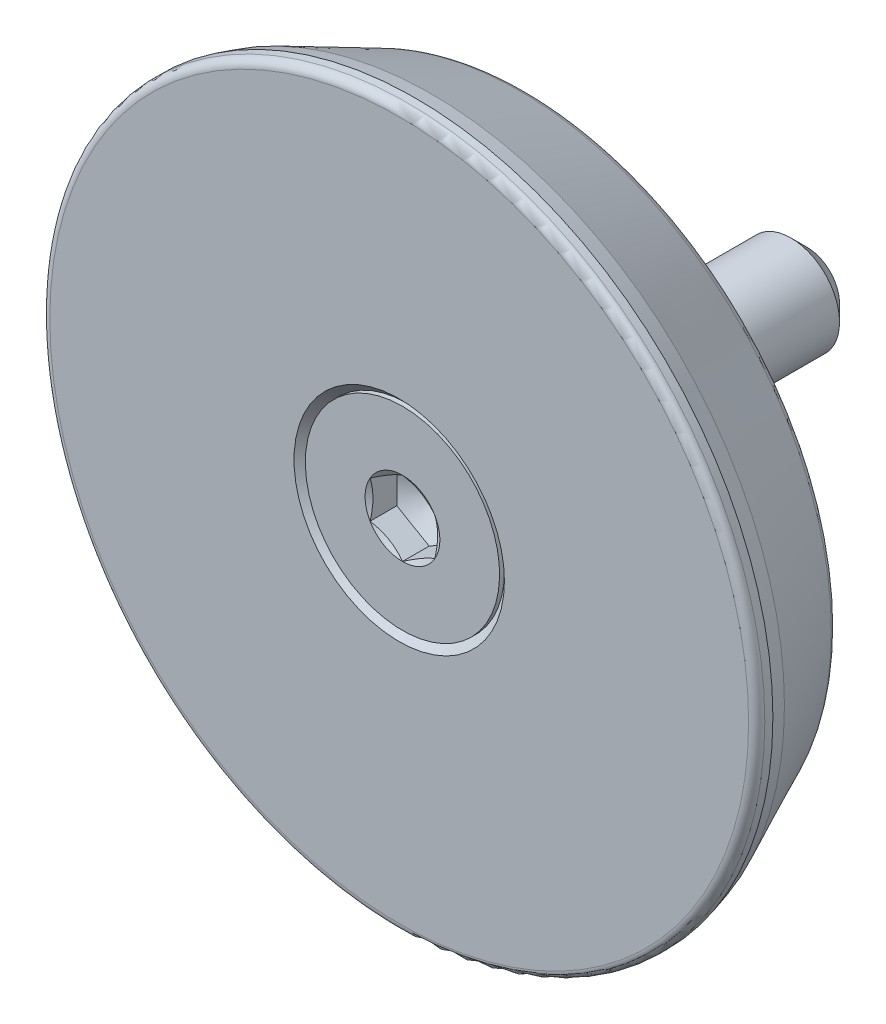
ISO-10303-21;
HEADER;
FILE_DESCRIPTION(('STEP AP214'),'2;1');
FILE_NAME('part.step','',(''),(''),'','','');
FILE_SCHEMA(('AUTOMOTIVE_DESIGN { 1 0 10303 214 1 1 1 1 }'));
ENDSEC;
DATA;
#1=APPLICATION_CONTEXT('core data for automotive mechanical design processes');
#2=APPLICATION_PROTOCOL_DEFINITION('international standard','automotive_design',2000,#1);
#3=PRODUCT_CONTEXT('',#1,'mechanical');
#4=PRODUCT('Part','Part','',(#3));
#5=PRODUCT_RELATED_PRODUCT_CATEGORY('part','',(#4));
#6=PRODUCT_DEFINITION_FORMATION('','',#4);
#7=PRODUCT_DEFINITION_CONTEXT('part definition',#1,'design');
#8=PRODUCT_DEFINITION('design','',#6,#7);
#9=PRODUCT_DEFINITION_SHAPE('','',#8);
#10=(LENGTH_UNIT() NAMED_UNIT(*) SI_UNIT(.MILLI.,.METRE.));
#11=(NAMED_UNIT(*) PLANE_ANGLE_UNIT() SI_UNIT($,.RADIAN.));
#12=(NAMED_UNIT(*) SI_UNIT($,.STERADIAN.) SOLID_ANGLE_UNIT());
#13=UNCERTAINTY_MEASURE_WITH_UNIT(LENGTH_MEASURE(1.E-05),#10,'distance_accuracy_value','');
#14=(GEOMETRIC_REPRESENTATION_CONTEXT(3) GLOBAL_UNCERTAINTY_ASSIGNED_CONTEXT((#13)) GLOBAL_UNIT_ASSIGNED_CONTEXT((#10,
#11,#12)) REPRESENTATION_CONTEXT('',''));
#15=CARTESIAN_POINT('',(0.,0.,0.));
#16=DIRECTION('',(0.,0.,1.));
#17=DIRECTION('',(1.,0.,0.));
#18=AXIS2_PLACEMENT_3D('',#15,#16,#17);
#19=CARTESIAN_POINT('',(0.,0.,-2.29999999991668));
#20=DIRECTION('',(0.,0.,1.));
#21=DIRECTION('',(0.,1.,0.));
#22=AXIS2_PLACEMENT_3D('',#19,#20,#21);
#23=CONICAL_SURFACE('',#22,2.30940107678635,1.0471975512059);
#24=CARTESIAN_POINT('',(0.,0.,-2.29999999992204));
#25=DIRECTION('',(0.,0.,1.));
#26=DIRECTION('',(0.,1.,0.));
#27=AXIS2_PLACEMENT_3D('',#24,#25,#26);
#28=CIRCLE('',#27,2.30940107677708);
#29=CARTESIAN_POINT('',(-2.00000000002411,-1.15470053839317,-2.29999999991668));
#30=VERTEX_POINT('',#29);
#31=CARTESIAN_POINT('',(0.,-2.30940107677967,-2.29999999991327));
#32=VERTEX_POINT('',#31);
#33=EDGE_CURVE('E678',#30,#32,#28,.T.);
#34=ORIENTED_EDGE('',*,*,#33,.T.);
#35=CARTESIAN_POINT('',(0.,0.,-2.29999999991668));
#36=DIRECTION('',(0.,0.,1.));
#37=DIRECTION('',(0.,1.,0.));
#38=AXIS2_PLACEMENT_3D('',#35,#36,#37);
#39=CIRCLE('',#38,2.30940107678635);
#40=CARTESIAN_POINT('',(2.00000000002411,-1.15470053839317,-2.29999999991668));
#41=VERTEX_POINT('',#40);
#42=EDGE_CURVE('E835',#41,#32,#39,.F.);
#43=ORIENTED_EDGE('',*,*,#42,.F.);
#44=CARTESIAN_POINT('',(0.,0.,-2.29999999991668));
#45=DIRECTION('',(0.,0.,1.));
#46=DIRECTION('',(0.,1.,0.));
#47=AXIS2_PLACEMENT_3D('',#44,#45,#46);
#48=CIRCLE('',#47,2.30940107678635);
#49=CARTESIAN_POINT('',(2.00000000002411,1.15470053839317,-2.29999999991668));
#50=VERTEX_POINT('',#49);
#51=EDGE_CURVE('E834',#50,#41,#48,.F.);
#52=ORIENTED_EDGE('',*,*,#51,.F.);
#53=CARTESIAN_POINT('',(0.,0.,-2.29999999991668));
#54=DIRECTION('',(0.,0.,1.));
#55=DIRECTION('',(0.,1.,0.));
#56=AXIS2_PLACEMENT_3D('',#53,#54,#55);
#57=CIRCLE('',#56,2.30940107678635);
#58=CARTESIAN_POINT('',(0.,2.30940107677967,-2.29999999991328));
#59=VERTEX_POINT('',#58);
#60=EDGE_CURVE('E706',#59,#50,#57,.F.);
#61=ORIENTED_EDGE('',*,*,#60,.F.);
#62=CARTESIAN_POINT('',(0.,0.,-2.29999999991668));
#63=DIRECTION('',(0.,0.,1.));
#64=DIRECTION('',(0.,1.,0.));
#65=AXIS2_PLACEMENT_3D('',#62,#63,#64);
#66=CIRCLE('',#65,2.30940107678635);
#67=CARTESIAN_POINT('',(-2.00000000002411,1.15470053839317,-2.29999999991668));
#68=VERTEX_POINT('',#67);
#69=EDGE_CURVE('E750',#68,#59,#66,.F.);
#70=ORIENTED_EDGE('',*,*,#69,.F.);
#71=CARTESIAN_POINT('',(0.,0.,-2.29999999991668));
#72=DIRECTION('',(0.,0.,1.));
#73=DIRECTION('',(0.,1.,0.));
#74=AXIS2_PLACEMENT_3D('',#71,#72,#73);
#75=CIRCLE('',#74,2.30940107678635);
#76=EDGE_CURVE('E830',#30,#68,#75,.F.);
#77=ORIENTED_EDGE('',*,*,#76,.F.);
#78=EDGE_LOOP('',(#34,#43,#52,#61,#70,#77));
#79=FACE_BOUND('',#78,.T.);
#80=CARTESIAN_POINT('',(0.,0.,-3.63333333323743));
#81=VERTEX_POINT('',#80);
#82=VERTEX_LOOP('',#81);
#83=FACE_BOUND('',#82,.T.);
#84=ADVANCED_FACE('F14',(#79,#83),#23,.F.);
#85=CARTESIAN_POINT('',(0.,0.,-2.29999999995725));
#86=DIRECTION('',(0.,0.,1.));
#87=DIRECTION('',(0.,1.,0.));
#88=AXIS2_PLACEMENT_3D('',#85,#86,#87);
#89=PLANE('',#88);
#90=ORIENTED_EDGE('',*,*,#51,.T.);
#91=DIRECTION('',(0.,1.,0.));
#92=VECTOR('',#91,1.);
#93=CARTESIAN_POINT('',(2.,0.,-2.29999999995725));
#94=LINE('',#93,#92);
#95=EDGE_CURVE('E793',#50,#41,#94,.F.);
#96=ORIENTED_EDGE('',*,*,#95,.F.);
#97=EDGE_LOOP('',(#90,#96));
#98=FACE_BOUND('',#97,.T.);
#99=ADVANCED_FACE('F716',(#98),#89,.F.);
#100=CARTESIAN_POINT('',(0.,0.,-2.29999999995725));
#101=DIRECTION('',(0.,0.,1.));
#102=DIRECTION('',(0.,1.,0.));
#103=AXIS2_PLACEMENT_3D('',#100,#101,#102);
#104=PLANE('',#103);
#105=ORIENTED_EDGE('',*,*,#60,.T.);
#106=DIRECTION('',(0.866025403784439,-0.5,0.));
#107=VECTOR('',#106,1.);
#108=CARTESIAN_POINT('',(0.,2.3094010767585,-2.29999999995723));
#109=LINE('',#108,#107);
#110=EDGE_CURVE('E796',#59,#50,#109,.T.);
#111=ORIENTED_EDGE('',*,*,#110,.F.);
#112=EDGE_LOOP('',(#105,#111));
#113=FACE_BOUND('',#112,.T.);
#114=ADVANCED_FACE('F712',(#113),#104,.F.);
#115=CARTESIAN_POINT('',(0.,0.,-2.29999999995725));
#116=DIRECTION('',(0.,0.,1.));
#117=DIRECTION('',(0.,1.,0.));
#118=AXIS2_PLACEMENT_3D('',#115,#116,#117);
#119=PLANE('',#118);
#120=ORIENTED_EDGE('',*,*,#69,.T.);
#121=DIRECTION('',(0.866025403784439,0.5,0.));
#122=VECTOR('',#121,1.);
#123=CARTESIAN_POINT('',(-2.,1.15470053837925,-2.29999999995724));
#124=LINE('',#123,#122);
#125=EDGE_CURVE('E785',#68,#59,#124,.T.);
#126=ORIENTED_EDGE('',*,*,#125,.F.);
#127=EDGE_LOOP('',(#120,#126));
#128=FACE_BOUND('',#127,.T.);
#129=ADVANCED_FACE('F715',(#128),#119,.F.);
#130=CARTESIAN_POINT('',(0.,0.,-2.29999999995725));
#131=DIRECTION('',(0.,0.,1.));
#132=DIRECTION('',(0.,1.,0.));
#133=AXIS2_PLACEMENT_3D('',#130,#131,#132);
#134=PLANE('',#133);
#135=ORIENTED_EDGE('',*,*,#76,.T.);
#136=DIRECTION('',(0.,1.,0.));
#137=VECTOR('',#136,1.);
#138=CARTESIAN_POINT('',(-2.,0.,-2.29999999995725));
#139=LINE('',#138,#137);
#140=EDGE_CURVE('E788',#30,#68,#139,.T.);
#141=ORIENTED_EDGE('',*,*,#140,.F.);
#142=EDGE_LOOP('',(#135,#141));
#143=FACE_BOUND('',#142,.T.);
#144=ADVANCED_FACE('F725',(#143),#134,.F.);
#145=CARTESIAN_POINT('',(0.,0.,-2.29999999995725));
#146=DIRECTION('',(0.,0.,1.));
#147=DIRECTION('',(0.,1.,0.));
#148=AXIS2_PLACEMENT_3D('',#145,#146,#147);
#149=PLANE('',#148);
#150=ORIENTED_EDGE('',*,*,#33,.F.);
#151=DIRECTION('',(0.866025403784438,-0.5,0.));
#152=VECTOR('',#151,1.);
#153=CARTESIAN_POINT('',(-2.,-1.15470053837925,-2.29999999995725));
#154=LINE('',#153,#152);
#155=EDGE_CURVE('E745',#32,#30,#154,.F.);
#156=ORIENTED_EDGE('',*,*,#155,.F.);
#157=EDGE_LOOP('',(#150,#156));
#158=FACE_BOUND('',#157,.T.);
#159=ADVANCED_FACE('F723',(#158),#149,.F.);
#160=CARTESIAN_POINT('',(0.,0.,-2.29999999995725));
#161=DIRECTION('',(0.,0.,1.));
#162=DIRECTION('',(0.,1.,0.));
#163=AXIS2_PLACEMENT_3D('',#160,#161,#162);
#164=PLANE('',#163);
#165=ORIENTED_EDGE('',*,*,#42,.T.);
#166=DIRECTION('',(-0.866025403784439,-0.5,0.));
#167=VECTOR('',#166,1.);
#168=CARTESIAN_POINT('',(2.,-1.15470053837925,-2.29999999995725));
#169=LINE('',#168,#167);
#170=EDGE_CURVE('E791',#41,#32,#169,.T.);
#171=ORIENTED_EDGE('',*,*,#170,.F.);
#172=EDGE_LOOP('',(#165,#171));
#173=FACE_BOUND('',#172,.T.);
#174=ADVANCED_FACE('F625',(#173),#164,.F.);
#175=CARTESIAN_POINT('',(2.,-1.15470053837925,-3.94999999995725));
#176=DIRECTION('',(-1.,0.,0.));
#177=DIRECTION('',(0.,1.,0.));
#178=AXIS2_PLACEMENT_3D('',#175,#176,#177);
#179=PLANE('',#178);
#180=DIRECTION('',(0.,0.,-1.));
#181=VECTOR('',#180,1.);
#182=CARTESIAN_POINT('',(2.,-1.15470053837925,-3.94999999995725));
#183=LINE('',#182,#181);
#184=CARTESIAN_POINT('',(2.00000000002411,-1.15470053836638,-0.649999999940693));
#185=VERTEX_POINT('',#184);
#186=EDGE_CURVE('E805',#185,#41,#183,.T.);
#187=ORIENTED_EDGE('',*,*,#186,.F.);
#188=CARTESIAN_POINT('',(2.,-1.15470053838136,-0.649999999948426));
#189=CARTESIAN_POINT('',(2.,-1.05991107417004,-0.677366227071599));
#190=CARTESIAN_POINT('',(2.,-0.964371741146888,-0.702420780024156));
#191=CARTESIAN_POINT('',(2.,-0.771741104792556,-0.746701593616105));
#192=CARTESIAN_POINT('',(2.,-0.67464683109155,-0.765914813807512));
#193=CARTESIAN_POINT('',(2.,-0.481547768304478,-0.796811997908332));
#194=CARTESIAN_POINT('',(2.,-0.385570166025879,-0.808660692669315));
#195=CARTESIAN_POINT('',(2.,-0.193061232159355,-0.824566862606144));
#196=CARTESIAN_POINT('',(2.,-0.0965306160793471,-0.828632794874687));
#197=CARTESIAN_POINT('',(2.,0.0965306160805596,-0.828632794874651));
#198=CARTESIAN_POINT('',(2.,0.193061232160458,-0.824566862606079));
#199=CARTESIAN_POINT('',(2.,0.385570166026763,-0.808660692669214));
#200=CARTESIAN_POINT('',(2.,0.481547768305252,-0.796811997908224));
#201=CARTESIAN_POINT('',(2.,0.674646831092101,-0.765914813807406));
#202=CARTESIAN_POINT('',(2.,0.771741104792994,-0.746701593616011));
#203=CARTESIAN_POINT('',(2.,0.964371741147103,-0.702420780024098));
#204=CARTESIAN_POINT('',(2.,1.05991107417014,-0.677366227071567));
#205=CARTESIAN_POINT('',(2.,1.15470053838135,-0.649999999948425));
#206=B_SPLINE_CURVE_WITH_KNOTS('',3,(#188,#189,#190,#191,#192,#193,#194,#195,#196,#197,#198,
#199,#200,#201,#202,#203,#204,#205),.UNSPECIFIED.,.F.,.F.,(4,2,2,2,2,2,2,2,4),(0.,
0.296073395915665,0.59280298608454,0.882630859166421,1.17214361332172,1.46165636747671,
1.75148424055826,2.0482138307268,2.34428722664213),.UNSPECIFIED.);
#207=CARTESIAN_POINT('',(2.00000000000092,1.15470053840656,-0.649999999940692));
#208=VERTEX_POINT('',#207);
#209=EDGE_CURVE('E603',#185,#208,#206,.T.);
#210=ORIENTED_EDGE('',*,*,#209,.T.);
#211=DIRECTION('',(0.,0.,-1.));
#212=VECTOR('',#211,1.);
#213=CARTESIAN_POINT('',(2.,1.15470053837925,-3.94999999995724));
#214=LINE('',#213,#212);
#215=EDGE_CURVE('E601',#208,#50,#214,.T.);
#216=ORIENTED_EDGE('',*,*,#215,.T.);
#217=ORIENTED_EDGE('',*,*,#95,.T.);
#218=EDGE_LOOP('',(#187,#210,#216,#217));
#219=FACE_BOUND('',#218,.T.);
#220=ADVANCED_FACE('F619',(#219),#179,.T.);
#221=CARTESIAN_POINT('',(2.,1.15470053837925,-3.94999999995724));
#222=DIRECTION('',(-0.5,-0.866025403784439,0.));
#223=DIRECTION('',(-0.866025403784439,0.5,0.));
#224=AXIS2_PLACEMENT_3D('',#221,#222,#223);
#225=PLANE('',#224);
#226=ORIENTED_EDGE('',*,*,#110,.T.);
#227=ORIENTED_EDGE('',*,*,#215,.F.);
#228=CARTESIAN_POINT('',(2.00000000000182,1.1547005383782,-0.649999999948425));
#229=CARTESIAN_POINT('',(1.9179099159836,1.20209527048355,-0.677366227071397));
#230=CARTESIAN_POINT('',(1.83517042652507,1.24986493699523,-0.702420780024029));
#231=CARTESIAN_POINT('',(1.66834740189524,1.34618025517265,-0.746701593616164));
#232=CARTESIAN_POINT('',(1.58426129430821,1.39472739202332,-0.765914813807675));
#233=CARTESIAN_POINT('',(1.41703260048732,1.49127692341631,-0.796811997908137));
#234=CARTESIAN_POINT('',(1.33391355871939,1.53926572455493,-0.808660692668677));
#235=CARTESIAN_POINT('',(1.16719593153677,1.63552019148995,-0.82456686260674));
#236=CARTESIAN_POINT('',(1.0835979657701,1.68378549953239,-0.828632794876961));
#237=CARTESIAN_POINT('',(0.916402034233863,1.78031611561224,-0.828632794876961));
#238=CARTESIAN_POINT('',(0.832804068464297,1.82858142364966,-0.824566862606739));
#239=CARTESIAN_POINT('',(0.66608644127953,1.92483589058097,-0.808660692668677));
#240=CARTESIAN_POINT('',(0.582967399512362,1.97282469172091,-0.796811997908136));
#241=CARTESIAN_POINT('',(0.415738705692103,2.06937422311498,-0.765914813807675));
#242=CARTESIAN_POINT('',(0.331652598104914,2.11792135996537,-0.746701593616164));
#243=CARTESIAN_POINT('',(0.164829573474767,2.21423667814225,-0.702420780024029));
#244=CARTESIAN_POINT('',(0.082090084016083,2.26200634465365,-0.677366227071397));
#245=CARTESIAN_POINT('',(-1.82348079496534E-12,2.30940107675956,-0.649999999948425));
#246=B_SPLINE_CURVE_WITH_KNOTS('',3,(#228,#229,#230,#231,#232,#233,#234,#235,#236,#237,#238,
#239,#240,#241,#242,#243,#244,#245),.UNSPECIFIED.,.F.,.F.,(4,2,2,2,2,2,2,2,4),(0.,
0.296073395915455,0.592802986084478,0.882630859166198,1.17214361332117,1.46165636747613,
1.75148424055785,2.04821383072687,2.34428722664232),.UNSPECIFIED.);
#247=CARTESIAN_POINT('',(-2.31987455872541E-11,2.30940107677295,-0.649999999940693));
#248=VERTEX_POINT('',#247);
#249=EDGE_CURVE('E124',#208,#248,#246,.T.);
#250=ORIENTED_EDGE('',*,*,#249,.T.);
#251=DIRECTION('',(0.,0.,-1.));
#252=VECTOR('',#251,1.);
#253=CARTESIAN_POINT('',(0.,2.3094010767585,-3.94999999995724));
#254=LINE('',#253,#252);
#255=EDGE_CURVE('E799',#59,#248,#254,.F.);
#256=ORIENTED_EDGE('',*,*,#255,.F.);
#257=EDGE_LOOP('',(#226,#227,#250,#256));
#258=FACE_BOUND('',#257,.T.);
#259=ADVANCED_FACE('F614',(#258),#225,.T.);
#260=CARTESIAN_POINT('',(0.,2.3094010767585,-3.94999999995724));
#261=DIRECTION('',(0.5,-0.866025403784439,0.));
#262=DIRECTION('',(-0.866025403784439,-0.5,0.));
#263=AXIS2_PLACEMENT_3D('',#260,#261,#262);
#264=PLANE('',#263);
#265=ORIENTED_EDGE('',*,*,#125,.T.);
#266=ORIENTED_EDGE('',*,*,#255,.T.);
#267=CARTESIAN_POINT('',(1.82255026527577E-12,2.30940107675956,-0.649999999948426));
#268=CARTESIAN_POINT('',(-0.0820900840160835,2.26200634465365,-0.677366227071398));
#269=CARTESIAN_POINT('',(-0.164829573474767,2.21423667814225,-0.702420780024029));
#270=CARTESIAN_POINT('',(-0.331652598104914,2.11792135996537,-0.746701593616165));
#271=CARTESIAN_POINT('',(-0.415738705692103,2.06937422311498,-0.765914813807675));
#272=CARTESIAN_POINT('',(-0.582967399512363,1.97282469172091,-0.796811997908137));
#273=CARTESIAN_POINT('',(-0.66608644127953,1.92483589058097,-0.808660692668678));
#274=CARTESIAN_POINT('',(-0.832804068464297,1.82858142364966,-0.82456686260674));
#275=CARTESIAN_POINT('',(-0.916402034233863,1.78031611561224,-0.828632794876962));
#276=CARTESIAN_POINT('',(-1.0835979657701,1.68378549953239,-0.828632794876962));
#277=CARTESIAN_POINT('',(-1.16719593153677,1.63552019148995,-0.824566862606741));
#278=CARTESIAN_POINT('',(-1.33391355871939,1.53926572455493,-0.808660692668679));
#279=CARTESIAN_POINT('',(-1.41703260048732,1.49127692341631,-0.796811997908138));
#280=CARTESIAN_POINT('',(-1.58426129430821,1.39472739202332,-0.765914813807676));
#281=CARTESIAN_POINT('',(-1.66834740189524,1.34618025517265,-0.746701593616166));
#282=CARTESIAN_POINT('',(-1.83517042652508,1.24986493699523,-0.70242078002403));
#283=CARTESIAN_POINT('',(-1.9179099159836,1.20209527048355,-0.677366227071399));
#284=CARTESIAN_POINT('',(-2.00000000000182,1.1547005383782,-0.649999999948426));
#285=B_SPLINE_CURVE_WITH_KNOTS('',3,(#267,#268,#269,#270,#271,#272,#273,#274,#275,#276,#277,
#278,#279,#280,#281,#282,#283,#284),.UNSPECIFIED.,.F.,.F.,(4,2,2,2,2,2,2,2,4),(0.,
0.296073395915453,0.592802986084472,0.88263085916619,1.17214361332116,1.46165636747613,
1.75148424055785,2.04821383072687,2.34428722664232),.UNSPECIFIED.);
#286=CARTESIAN_POINT('',(-2.00000000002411,1.15470053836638,-0.649999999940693));
#287=VERTEX_POINT('',#286);
#288=EDGE_CURVE('E697',#248,#287,#285,.T.);
#289=ORIENTED_EDGE('',*,*,#288,.T.);
#290=DIRECTION('',(0.,0.,-1.));
#291=VECTOR('',#290,1.);
#292=CARTESIAN_POINT('',(-2.,1.15470053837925,-3.94999999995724));
#293=LINE('',#292,#291);
#294=EDGE_CURVE('E704',#287,#68,#293,.T.);
#295=ORIENTED_EDGE('',*,*,#294,.T.);
#296=EDGE_LOOP('',(#265,#266,#289,#295));
#297=FACE_BOUND('',#296,.T.);
#298=ADVANCED_FACE('F618',(#297),#264,.T.);
#299=CARTESIAN_POINT('',(-2.,1.15470053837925,-3.94999999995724));
#300=DIRECTION('',(1.,0.,0.));
#301=DIRECTION('',(0.,0.,-1.));
#302=AXIS2_PLACEMENT_3D('',#299,#300,#301);
#303=PLANE('',#302);
#304=ORIENTED_EDGE('',*,*,#140,.T.);
#305=ORIENTED_EDGE('',*,*,#294,.F.);
#306=CARTESIAN_POINT('',(-2.,1.15470053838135,-0.649999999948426));
#307=CARTESIAN_POINT('',(-1.99999999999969,1.0599110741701,-0.677366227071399));
#308=CARTESIAN_POINT('',(-1.99999999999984,0.96437174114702,-0.702420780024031));
#309=CARTESIAN_POINT('',(-2.00000000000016,0.771741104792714,-0.746701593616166));
#310=CARTESIAN_POINT('',(-2.00000000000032,0.674646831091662,-0.765914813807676));
#311=CARTESIAN_POINT('',(-1.99999999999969,0.481547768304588,-0.796811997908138));
#312=CARTESIAN_POINT('',(-1.99999999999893,0.385570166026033,-0.808660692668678));
#313=CARTESIAN_POINT('',(-2.00000000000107,0.193061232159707,-0.82456686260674));
#314=CARTESIAN_POINT('',(-2.00000000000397,0.0965306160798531,-0.828632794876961));
#315=CARTESIAN_POINT('',(-2.00000000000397,-0.0965306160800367,-0.828632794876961));
#316=CARTESIAN_POINT('',(-2.00000000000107,-0.193061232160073,-0.824566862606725));
#317=CARTESIAN_POINT('',(-1.99999999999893,-0.385570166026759,-0.808660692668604));
#318=CARTESIAN_POINT('',(-1.99999999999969,-0.481547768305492,-0.79681199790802));
#319=CARTESIAN_POINT('',(-2.00000000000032,-0.674646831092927,-0.765914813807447));
#320=CARTESIAN_POINT('',(-2.00000000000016,-0.77174110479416,-0.746701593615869));
#321=CARTESIAN_POINT('',(-1.99999999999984,-0.964371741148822,-0.702420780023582));
#322=CARTESIAN_POINT('',(-1.99999999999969,-1.05991107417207,-0.677366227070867));
#323=CARTESIAN_POINT('',(-2.,-1.1547005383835,-0.649999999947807));
#324=B_SPLINE_CURVE_WITH_KNOTS('',3,(#306,#307,#308,#309,#310,#311,#312,#313,#314,#315,#316,
#317,#318,#319,#320,#321,#322,#323),.UNSPECIFIED.,.F.,.F.,(4,2,2,2,2,2,2,2,4),(0.,
0.296073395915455,0.592802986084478,0.882630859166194,1.17214361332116,1.46165636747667,
1.75148424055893,2.04821383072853,2.34428722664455),.UNSPECIFIED.);
#325=CARTESIAN_POINT('',(-2.00000000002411,-1.15470053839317,-0.649999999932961));
#326=VERTEX_POINT('',#325);
#327=EDGE_CURVE('E644',#287,#326,#324,.T.);
#328=ORIENTED_EDGE('',*,*,#327,.T.);
#329=DIRECTION('',(0.,0.,-1.));
#330=VECTOR('',#329,1.);
#331=CARTESIAN_POINT('',(-2.,-1.15470053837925,-3.94999999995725));
#332=LINE('',#331,#330);
#333=EDGE_CURVE('E705',#326,#30,#332,.T.);
#334=ORIENTED_EDGE('',*,*,#333,.T.);
#335=EDGE_LOOP('',(#304,#305,#328,#334));
#336=FACE_BOUND('',#335,.T.);
#337=ADVANCED_FACE('F634',(#336),#303,.T.);
#338=CARTESIAN_POINT('',(-2.,-1.15470053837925,-3.94999999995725));
#339=DIRECTION('',(0.5,0.866025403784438,0.));
#340=DIRECTION('',(0.866025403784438,-0.5,0.));
#341=AXIS2_PLACEMENT_3D('',#338,#339,#340);
#342=PLANE('',#341);
#343=ORIENTED_EDGE('',*,*,#333,.F.);
#344=CARTESIAN_POINT('',(-2.00000000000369,-1.15470053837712,-0.649999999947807));
#345=CARTESIAN_POINT('',(-1.91790991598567,-1.20209527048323,-0.677366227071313));
#346=CARTESIAN_POINT('',(-1.83517042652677,-1.24986493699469,-0.702420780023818));
#347=CARTESIAN_POINT('',(-1.66834740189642,-1.34618025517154,-0.746701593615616));
#348=CARTESIAN_POINT('',(-1.58426129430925,-1.39472739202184,-0.765914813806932));
#349=CARTESIAN_POINT('',(-1.41703260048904,-1.49127692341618,-0.796811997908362));
#350=CARTESIAN_POINT('',(-1.3339135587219,-1.53926572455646,-0.808660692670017));
#351=CARTESIAN_POINT('',(-1.16719593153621,-1.63552019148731,-0.82456686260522));
#352=CARTESIAN_POINT('',(-1.0835979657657,-1.68378549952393,-0.828632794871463));
#353=CARTESIAN_POINT('',(-0.916402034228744,-1.7803161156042,-0.828632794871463));
#354=CARTESIAN_POINT('',(-0.832804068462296,-1.82858142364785,-0.82456686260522));
#355=CARTESIAN_POINT('',(-0.666086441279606,-1.92483589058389,-0.808660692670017));
#356=CARTESIAN_POINT('',(-0.582967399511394,-1.97282469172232,-0.796811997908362));
#357=CARTESIAN_POINT('',(-0.415738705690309,-2.06937422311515,-0.765914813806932));
#358=CARTESIAN_POINT('',(-0.331652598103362,-2.11792135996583,-0.746701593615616));
#359=CARTESIAN_POINT('',(-0.164829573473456,-2.21423667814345,-0.702420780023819));
#360=CARTESIAN_POINT('',(-0.0820900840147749,-2.26200634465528,-0.677366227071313));
#361=CARTESIAN_POINT('',(3.67936697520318E-12,-2.30940107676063,-0.649999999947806));
#362=B_SPLINE_CURVE_WITH_KNOTS('',3,(#344,#345,#346,#347,#348,#349,#350,#351,#352,#353,#354,
#355,#356,#357,#358,#359,#360,#361),.UNSPECIFIED.,.F.,.F.,(4,2,2,2,2,2,2,2,4),(0.,
0.296073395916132,0.592802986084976,0.882630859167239,1.17214361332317,1.4616563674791,
1.75148424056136,2.0482138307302,2.34428722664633),.UNSPECIFIED.);
#363=CARTESIAN_POINT('',(2.22656305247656E-11,-2.30940107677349,-0.649999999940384));
#364=VERTEX_POINT('',#363);
#365=EDGE_CURVE('E665',#326,#364,#362,.T.);
#366=ORIENTED_EDGE('',*,*,#365,.T.);
#367=DIRECTION('',(0.,0.,-1.));
#368=VECTOR('',#367,1.);
#369=CARTESIAN_POINT('',(0.,-2.3094010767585,-3.94999999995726));
#370=LINE('',#369,#368);
#371=EDGE_CURVE('E645',#32,#364,#370,.F.);
#372=ORIENTED_EDGE('',*,*,#371,.F.);
#373=ORIENTED_EDGE('',*,*,#155,.T.);
#374=EDGE_LOOP('',(#343,#366,#372,#373));
#375=FACE_BOUND('',#374,.T.);
#376=ADVANCED_FACE('F632',(#375),#342,.T.);
#377=CARTESIAN_POINT('',(0.,-2.3094010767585,-3.94999999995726));
#378=DIRECTION('',(-0.5,0.866025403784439,0.));
#379=DIRECTION('',(0.866025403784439,0.5,0.));
#380=AXIS2_PLACEMENT_3D('',#377,#378,#379);
#381=PLANE('',#380);
#382=ORIENTED_EDGE('',*,*,#371,.T.);
#383=CARTESIAN_POINT('',(-3.68507305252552E-12,-2.30940107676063,-0.649999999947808));
#384=CARTESIAN_POINT('',(0.0820900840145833,-2.26200634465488,-0.677366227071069));
#385=CARTESIAN_POINT('',(0.164829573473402,-2.21423667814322,-0.70242078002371));
#386=CARTESIAN_POINT('',(0.331652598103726,-2.11792135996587,-0.746701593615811));
#387=CARTESIAN_POINT('',(0.415738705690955,-2.06937422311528,-0.765914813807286));
#388=CARTESIAN_POINT('',(0.582967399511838,-1.97282469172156,-0.796811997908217));
#389=CARTESIAN_POINT('',(0.666086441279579,-1.92483589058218,-0.808660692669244));
#390=CARTESIAN_POINT('',(0.832804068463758,-1.82858142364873,-0.824566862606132));
#391=CARTESIAN_POINT('',(0.916402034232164,-1.78031611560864,-0.82863279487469));
#392=CARTESIAN_POINT('',(1.08359796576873,-1.6837854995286,-0.828632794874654));
#393=CARTESIAN_POINT('',(1.16719593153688,-1.63552019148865,-0.824566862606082));
#394=CARTESIAN_POINT('',(1.33391355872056,-1.53926572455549,-0.808660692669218));
#395=CARTESIAN_POINT('',(1.41703260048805,-1.49127692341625,-0.796811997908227));
#396=CARTESIAN_POINT('',(1.58426129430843,-1.39472739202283,-0.765914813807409));
#397=CARTESIAN_POINT('',(1.6683474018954,-1.34618025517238,-0.746701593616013));
#398=CARTESIAN_POINT('',(1.83517042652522,-1.24986493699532,-0.7024207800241));
#399=CARTESIAN_POINT('',(1.9179099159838,-1.2020952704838,-0.677366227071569));
#400=CARTESIAN_POINT('',(2.00000000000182,-1.1547005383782,-0.649999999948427));
#401=B_SPLINE_CURVE_WITH_KNOTS('',3,(#383,#384,#385,#386,#387,#388,#389,#390,#391,#392,#393,
#394,#395,#396,#397,#398,#399,#400),.UNSPECIFIED.,.F.,.F.,(4,2,2,2,2,2,2,2,4),(0.,
0.296073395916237,0.592802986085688,0.882630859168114,1.17214361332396,1.46165636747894,
1.7514842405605,2.04821383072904,2.34428722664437),.UNSPECIFIED.);
#402=EDGE_CURVE('E637',#364,#185,#401,.T.);
#403=ORIENTED_EDGE('',*,*,#402,.T.);
#404=ORIENTED_EDGE('',*,*,#186,.T.);
#405=ORIENTED_EDGE('',*,*,#170,.T.);
#406=EDGE_LOOP('',(#382,#403,#404,#405));
#407=FACE_BOUND('',#406,.T.);
#408=ADVANCED_FACE('F627',(#407),#381,.T.);
#409=CARTESIAN_POINT('',(0.,0.,-0.64999999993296));
#410=DIRECTION('',(0.,0.,1.));
#411=DIRECTION('',(0.,1.,0.));
#412=AXIS2_PLACEMENT_3D('',#409,#410,#411);
#413=CONICAL_SURFACE('',#412,2.30940107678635,1.04719755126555);
#414=ORIENTED_EDGE('',*,*,#209,.F.);
#415=CARTESIAN_POINT('',(0.,0.,-0.64999999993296));
#416=DIRECTION('',(0.,0.,1.));
#417=DIRECTION('',(0.,1.,0.));
#418=AXIS2_PLACEMENT_3D('',#415,#416,#417);
#419=CIRCLE('',#418,2.30940107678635);
#420=EDGE_CURVE('E769',#208,#185,#419,.F.);
#421=ORIENTED_EDGE('',*,*,#420,.F.);
#422=EDGE_LOOP('',(#414,#421));
#423=FACE_BOUND('',#422,.T.);
#424=ADVANCED_FACE('F631',(#423),#413,.F.);
#425=CARTESIAN_POINT('',(0.,0.,-0.64999999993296));
#426=DIRECTION('',(0.,0.,1.));
#427=DIRECTION('',(0.,1.,0.));
#428=AXIS2_PLACEMENT_3D('',#425,#426,#427);
#429=CONICAL_SURFACE('',#428,2.30940107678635,1.04719755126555);
#430=CARTESIAN_POINT('',(0.,0.,-0.64999999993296));
#431=DIRECTION('',(0.,0.,1.));
#432=DIRECTION('',(0.,1.,0.));
#433=AXIS2_PLACEMENT_3D('',#430,#431,#432);
#434=CIRCLE('',#433,2.30940107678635);
#435=EDGE_CURVE('E772',#248,#208,#434,.F.);
#436=ORIENTED_EDGE('',*,*,#435,.F.);
#437=ORIENTED_EDGE('',*,*,#249,.F.);
#438=EDGE_LOOP('',(#436,#437));
#439=FACE_BOUND('',#438,.T.);
#440=ADVANCED_FACE('F611',(#439),#429,.F.);
#441=CARTESIAN_POINT('',(0.,0.,-0.64999999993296));
#442=DIRECTION('',(0.,0.,1.));
#443=DIRECTION('',(0.,1.,0.));
#444=AXIS2_PLACEMENT_3D('',#441,#442,#443);
#445=CONICAL_SURFACE('',#444,2.30940107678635,1.04719755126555);
#446=CARTESIAN_POINT('',(0.,0.,-0.64999999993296));
#447=DIRECTION('',(0.,0.,1.));
#448=DIRECTION('',(0.,1.,0.));
#449=AXIS2_PLACEMENT_3D('',#446,#447,#448);
#450=CIRCLE('',#449,2.30940107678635);
#451=EDGE_CURVE('E774',#287,#248,#450,.F.);
#452=ORIENTED_EDGE('',*,*,#451,.F.);
#453=ORIENTED_EDGE('',*,*,#288,.F.);
#454=EDGE_LOOP('',(#452,#453));
#455=FACE_BOUND('',#454,.T.);
#456=ADVANCED_FACE('F692',(#455),#445,.F.);
#457=CARTESIAN_POINT('',(0.,0.,-0.64999999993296));
#458=DIRECTION('',(0.,0.,1.));
#459=DIRECTION('',(0.,1.,0.));
#460=AXIS2_PLACEMENT_3D('',#457,#458,#459);
#461=CONICAL_SURFACE('',#460,2.30940107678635,1.04719755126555);
#462=CARTESIAN_POINT('',(0.,0.,-0.64999999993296));
#463=DIRECTION('',(0.,0.,1.));
#464=DIRECTION('',(0.,1.,0.));
#465=AXIS2_PLACEMENT_3D('',#462,#463,#464);
#466=CIRCLE('',#465,2.30940107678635);
#467=EDGE_CURVE('E676',#326,#287,#466,.F.);
#468=ORIENTED_EDGE('',*,*,#467,.F.);
#469=ORIENTED_EDGE('',*,*,#327,.F.);
#470=EDGE_LOOP('',(#468,#469));
#471=FACE_BOUND('',#470,.T.);
#472=ADVANCED_FACE('F661',(#471),#461,.F.);
#473=CARTESIAN_POINT('',(0.,0.,-0.64999999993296));
#474=DIRECTION('',(0.,0.,1.));
#475=DIRECTION('',(0.,1.,0.));
#476=AXIS2_PLACEMENT_3D('',#473,#474,#475);
#477=CONICAL_SURFACE('',#476,2.30940107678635,1.04719755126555);
#478=ORIENTED_EDGE('',*,*,#365,.F.);
#479=CARTESIAN_POINT('',(0.,0.,-0.64999999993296));
#480=DIRECTION('',(0.,0.,1.));
#481=DIRECTION('',(0.,1.,0.));
#482=AXIS2_PLACEMENT_3D('',#479,#480,#481);
#483=CIRCLE('',#482,2.30940107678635);
#484=EDGE_CURVE('E764',#364,#326,#483,.F.);
#485=ORIENTED_EDGE('',*,*,#484,.F.);
#486=EDGE_LOOP('',(#478,#485));
#487=FACE_BOUND('',#486,.T.);
#488=ADVANCED_FACE('F656',(#487),#477,.F.);
#489=CARTESIAN_POINT('',(0.,0.,-0.64999999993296));
#490=DIRECTION('',(0.,0.,1.));
#491=DIRECTION('',(0.,1.,0.));
#492=AXIS2_PLACEMENT_3D('',#489,#490,#491);
#493=CONICAL_SURFACE('',#492,2.30940107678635,1.04719755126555);
#494=ORIENTED_EDGE('',*,*,#402,.F.);
#495=CARTESIAN_POINT('',(0.,0.,-0.64999999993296));
#496=DIRECTION('',(0.,0.,1.));
#497=DIRECTION('',(0.,1.,0.));
#498=AXIS2_PLACEMENT_3D('',#495,#496,#497);
#499=CIRCLE('',#498,2.30940107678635);
#500=EDGE_CURVE('E766',#185,#364,#499,.F.);
#501=ORIENTED_EDGE('',*,*,#500,.F.);
#502=EDGE_LOOP('',(#494,#501));
#503=FACE_BOUND('',#502,.T.);
#504=ADVANCED_FACE('F652',(#503),#493,.F.);
#505=CARTESIAN_POINT('',(0.,3.,-0.649999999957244));
#506=DIRECTION('',(0.,0.,1.));
#507=DIRECTION('',(0.,1.,0.));
#508=AXIS2_PLACEMENT_3D('',#505,#506,#507);
#509=PLANE('',#508);
#510=CARTESIAN_POINT('',(0.,0.,-0.649999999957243));
#511=DIRECTION('',(0.,0.,1.));
#512=DIRECTION('',(0.,1.,0.));
#513=AXIS2_PLACEMENT_3D('',#510,#511,#512);
#514=CIRCLE('',#513,6.);
#515=CARTESIAN_POINT('',(0.,6.,-0.649999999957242));
#516=VERTEX_POINT('',#515);
#517=EDGE_CURVE('E593',#516,#516,#514,.T.);
#518=ORIENTED_EDGE('',*,*,#517,.T.);
#519=EDGE_LOOP('',(#518));
#520=FACE_BOUND('',#519,.T.);
#521=ORIENTED_EDGE('',*,*,#500,.T.);
#522=ORIENTED_EDGE('',*,*,#484,.T.);
#523=ORIENTED_EDGE('',*,*,#467,.T.);
#524=ORIENTED_EDGE('',*,*,#451,.T.);
#525=ORIENTED_EDGE('',*,*,#435,.T.);
#526=ORIENTED_EDGE('',*,*,#420,.T.);
#527=EDGE_LOOP('',(#521,#522,#523,#524,#525,#526));
#528=FACE_BOUND('',#527,.T.);
#529=ADVANCED_FACE('F388',(#520,#528),#509,.T.);
#530=CARTESIAN_POINT('',(0.,0.,-0.799999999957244));
#531=DIRECTION('',(0.,0.,1.));
#532=DIRECTION('',(0.,1.,0.));
#533=AXIS2_PLACEMENT_3D('',#530,#531,#532);
#534=CYLINDRICAL_SURFACE('',#533,6.);
#535=ORIENTED_EDGE('',*,*,#517,.F.);
#536=EDGE_LOOP('',(#535));
#537=FACE_BOUND('',#536,.T.);
#538=CARTESIAN_POINT('',(0.,0.,-0.949999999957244));
#539=DIRECTION('',(0.,0.,1.));
#540=DIRECTION('',(0.,1.,0.));
#541=AXIS2_PLACEMENT_3D('',#538,#539,#540);
#542=CIRCLE('',#541,6.);
#543=CARTESIAN_POINT('',(0.,6.,-0.949999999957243));
#544=VERTEX_POINT('',#543);
#545=EDGE_CURVE('E674',#544,#544,#542,.T.);
#546=ORIENTED_EDGE('',*,*,#545,.T.);
#547=EDGE_LOOP('',(#546));
#548=FACE_BOUND('',#547,.T.);
#549=ADVANCED_FACE('F663',(#537,#548),#534,.T.);
#550=CARTESIAN_POINT('',(0.,0.,-25.6499999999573));
#551=DIRECTION('',(0.,0.,-1.));
#552=DIRECTION('',(0.,-1.,0.));
#553=AXIS2_PLACEMENT_3D('',#550,#551,#552);
#554=PLANE('',#553);
#555=CARTESIAN_POINT('',(0.,0.,-25.6499999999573));
#556=DIRECTION('',(0.,0.,-1.));
#557=DIRECTION('',(0.,-1.,0.));
#558=AXIS2_PLACEMENT_3D('',#555,#556,#557);
#559=CIRCLE('',#558,2.);
#560=CARTESIAN_POINT('',(0.,-2.,-25.6499999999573));
#561=VERTEX_POINT('',#560);
#562=EDGE_CURVE('E590',#561,#561,#559,.T.);
#563=ORIENTED_EDGE('',*,*,#562,.T.);
#564=EDGE_LOOP('',(#563));
#565=FACE_BOUND('',#564,.T.);
#566=ADVANCED_FACE('F258',(#565),#554,.T.);
#567=CARTESIAN_POINT('',(0.,0.,-25.6499999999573));
#568=DIRECTION('',(0.,0.,1.));
#569=DIRECTION('',(0.,1.,0.));
#570=AXIS2_PLACEMENT_3D('',#567,#568,#569);
#571=CONICAL_SURFACE('',#570,2.,0.785398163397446);
#572=CARTESIAN_POINT('',(0.,0.,-24.6499999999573));
#573=DIRECTION('',(0.,0.,-1.));
#574=DIRECTION('',(0.,-1.,0.));
#575=AXIS2_PLACEMENT_3D('',#572,#573,#574);
#576=CIRCLE('',#575,3.);
#577=CARTESIAN_POINT('',(0.,-3.,-24.6499999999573));
#578=VERTEX_POINT('',#577);
#579=EDGE_CURVE('E587',#578,#578,#576,.F.);
#580=ORIENTED_EDGE('',*,*,#579,.F.);
#581=EDGE_LOOP('',(#580));
#582=FACE_BOUND('',#581,.T.);
#583=ORIENTED_EDGE('',*,*,#562,.F.);
#584=EDGE_LOOP('',(#583));
#585=FACE_BOUND('',#584,.T.);
#586=ADVANCED_FACE('F934',(#582,#585),#571,.T.);
#587=CARTESIAN_POINT('',(0.,0.,-7.29999999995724));
#588=DIRECTION('',(0.,0.,1.));
#589=DIRECTION('',(0.,1.,0.));
#590=AXIS2_PLACEMENT_3D('',#587,#588,#589);
#591=CYLINDRICAL_SURFACE('',#590,3.);
#592=DIRECTION('',(0.,0.,1.));
#593=VECTOR('',#592,1.);
#594=CARTESIAN_POINT('',(-0.0948736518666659,2.99849945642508,-7.29999999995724));
#595=LINE('',#594,#593);
#596=CARTESIAN_POINT('',(-0.0948736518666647,2.99849945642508,-9.17057713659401));
#597=VERTEX_POINT('',#596);
#598=CARTESIAN_POINT('',(-0.0948736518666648,2.99849945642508,-9.63245735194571));
#599=VERTEX_POINT('',#598);
#600=EDGE_CURVE('E9',#597,#599,#595,.F.);
#601=ORIENTED_EDGE('',*,*,#600,.F.);
#602=CARTESIAN_POINT('',(0.,0.,-9.17057713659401));
#603=DIRECTION('',(0.,0.,1.));
#604=DIRECTION('',(0.,-1.,0.));
#605=AXIS2_PLACEMENT_3D('',#602,#603,#604);
#606=CIRCLE('',#605,3.);
#607=CARTESIAN_POINT('',(-2.54933987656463,1.58141272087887,-9.17057713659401));
#608=VERTEX_POINT('',#607);
#609=EDGE_CURVE('E205',#608,#597,#606,.F.);
#610=ORIENTED_EDGE('',*,*,#609,.F.);
#611=DIRECTION('',(0.,0.,1.));
#612=VECTOR('',#611,1.);
#613=CARTESIAN_POINT('',(-2.54933987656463,1.58141272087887,-7.29999999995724));
#614=LINE('',#613,#612);
#615=CARTESIAN_POINT('',(-2.54933987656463,1.58141272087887,-9.63245735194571));
#616=VERTEX_POINT('',#615);
#617=EDGE_CURVE('E198',#616,#608,#614,.T.);
#618=ORIENTED_EDGE('',*,*,#617,.F.);
#619=CARTESIAN_POINT('',(0.,0.,-9.63245735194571));
#620=DIRECTION('',(0.,0.,1.));
#621=DIRECTION('',(0.,-1.,0.));
#622=AXIS2_PLACEMENT_3D('',#619,#620,#621);
#623=CIRCLE('',#622,3.);
#624=EDGE_CURVE('E24',#599,#616,#623,.T.);
#625=ORIENTED_EDGE('',*,*,#624,.F.);
#626=EDGE_LOOP('',(#601,#610,#618,#625));
#627=FACE_BOUND('',#626,.T.);
#628=DIRECTION('',(0.,0.,1.));
#629=VECTOR('',#628,1.);
#630=CARTESIAN_POINT('',(-2.64421352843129,1.41708673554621,-7.29999999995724));
#631=LINE('',#630,#629);
#632=CARTESIAN_POINT('',(-2.64421352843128,1.4170867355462,-9.17057713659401));
#633=VERTEX_POINT('',#632);
#634=CARTESIAN_POINT('',(-2.64421352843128,1.4170867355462,-9.63245735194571));
#635=VERTEX_POINT('',#634);
#636=EDGE_CURVE('E206',#633,#635,#631,.F.);
#637=ORIENTED_EDGE('',*,*,#636,.F.);
#638=CARTESIAN_POINT('',(0.,0.,-9.17057713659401));
#639=DIRECTION('',(0.,0.,1.));
#640=DIRECTION('',(0.,-1.,0.));
#641=AXIS2_PLACEMENT_3D('',#638,#639,#640);
#642=CIRCLE('',#641,3.);
#643=CARTESIAN_POINT('',(-2.64421352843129,-1.41708673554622,-9.17057713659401));
#644=VERTEX_POINT('',#643);
#645=EDGE_CURVE('E515',#644,#633,#642,.F.);
#646=ORIENTED_EDGE('',*,*,#645,.F.);
#647=DIRECTION('',(0.,0.,1.));
#648=VECTOR('',#647,1.);
#649=CARTESIAN_POINT('',(-2.64421352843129,-1.41708673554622,-7.29999999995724));
#650=LINE('',#649,#648);
#651=CARTESIAN_POINT('',(-2.64421352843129,-1.41708673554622,-9.6324573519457));
#652=VERTEX_POINT('',#651);
#653=EDGE_CURVE('E509',#652,#644,#650,.T.);
#654=ORIENTED_EDGE('',*,*,#653,.F.);
#655=CARTESIAN_POINT('',(0.,0.,-9.63245735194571));
#656=DIRECTION('',(0.,0.,1.));
#657=DIRECTION('',(0.,-1.,0.));
#658=AXIS2_PLACEMENT_3D('',#655,#656,#657);
#659=CIRCLE('',#658,3.);
#660=EDGE_CURVE('E518',#635,#652,#659,.T.);
#661=ORIENTED_EDGE('',*,*,#660,.F.);
#662=EDGE_LOOP('',(#637,#646,#654,#661));
#663=FACE_BOUND('',#662,.T.);
#664=DIRECTION('',(0.,0.,1.));
#665=VECTOR('',#664,1.);
#666=CARTESIAN_POINT('',(-2.54933987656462,-1.58141272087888,-7.29999999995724));
#667=LINE('',#666,#665);
#668=CARTESIAN_POINT('',(-2.54933987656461,-1.58141272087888,-9.17057713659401));
#669=VERTEX_POINT('',#668);
#670=CARTESIAN_POINT('',(-2.54933987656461,-1.58141272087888,-9.63245735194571));
#671=VERTEX_POINT('',#670);
#672=EDGE_CURVE('E506',#669,#671,#667,.F.);
#673=ORIENTED_EDGE('',*,*,#672,.F.);
#674=CARTESIAN_POINT('',(0.,0.,-9.17057713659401));
#675=DIRECTION('',(0.,0.,1.));
#676=DIRECTION('',(0.,-1.,0.));
#677=AXIS2_PLACEMENT_3D('',#674,#675,#676);
#678=CIRCLE('',#677,3.);
#679=CARTESIAN_POINT('',(-0.094873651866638,-2.99849945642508,-9.17057713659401));
#680=VERTEX_POINT('',#679);
#681=EDGE_CURVE('E507',#680,#669,#678,.F.);
#682=ORIENTED_EDGE('',*,*,#681,.F.);
#683=DIRECTION('',(0.,0.,1.));
#684=VECTOR('',#683,1.);
#685=CARTESIAN_POINT('',(-0.0948736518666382,-2.99849945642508,-7.29999999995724));
#686=LINE('',#685,#684);
#687=CARTESIAN_POINT('',(-0.0948736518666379,-2.99849945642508,-9.63245735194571));
#688=VERTEX_POINT('',#687);
#689=EDGE_CURVE('E473',#688,#680,#686,.T.);
#690=ORIENTED_EDGE('',*,*,#689,.F.);
#691=CARTESIAN_POINT('',(0.,0.,-9.63245735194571));
#692=DIRECTION('',(0.,0.,1.));
#693=DIRECTION('',(0.,-1.,0.));
#694=AXIS2_PLACEMENT_3D('',#691,#692,#693);
#695=CIRCLE('',#694,3.);
#696=EDGE_CURVE('E502',#671,#688,#695,.T.);
#697=ORIENTED_EDGE('',*,*,#696,.F.);
#698=EDGE_LOOP('',(#673,#682,#690,#697));
#699=FACE_BOUND('',#698,.T.);
#700=DIRECTION('',(0.,0.,1.));
#701=VECTOR('',#700,1.);
#702=CARTESIAN_POINT('',(0.094873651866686,-2.99849945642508,-7.29999999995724));
#703=LINE('',#702,#701);
#704=CARTESIAN_POINT('',(0.094873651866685,-2.99849945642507,-9.17057713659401));
#705=VERTEX_POINT('',#704);
#706=CARTESIAN_POINT('',(0.0948736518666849,-2.99849945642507,-9.63245735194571));
#707=VERTEX_POINT('',#706);
#708=EDGE_CURVE('E494',#705,#707,#703,.F.);
#709=ORIENTED_EDGE('',*,*,#708,.F.);
#710=CARTESIAN_POINT('',(0.,0.,-9.17057713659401));
#711=DIRECTION('',(0.,0.,1.));
#712=DIRECTION('',(0.,-1.,0.));
#713=AXIS2_PLACEMENT_3D('',#710,#711,#712);
#714=CIRCLE('',#713,3.);
#715=CARTESIAN_POINT('',(2.54933987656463,-1.58141272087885,-9.17057713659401));
#716=VERTEX_POINT('',#715);
#717=EDGE_CURVE('E559',#716,#705,#714,.F.);
#718=ORIENTED_EDGE('',*,*,#717,.F.);
#719=DIRECTION('',(0.,0.,1.));
#720=VECTOR('',#719,1.);
#721=CARTESIAN_POINT('',(2.54933987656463,-1.58141272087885,-7.29999999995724));
#722=LINE('',#721,#720);
#723=CARTESIAN_POINT('',(2.54933987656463,-1.58141272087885,-9.6324573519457));
#724=VERTEX_POINT('',#723);
#725=EDGE_CURVE('E556',#724,#716,#722,.T.);
#726=ORIENTED_EDGE('',*,*,#725,.F.);
#727=CARTESIAN_POINT('',(0.,0.,-9.63245735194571));
#728=DIRECTION('',(0.,0.,1.));
#729=DIRECTION('',(0.,-1.,0.));
#730=AXIS2_PLACEMENT_3D('',#727,#728,#729);
#731=CIRCLE('',#730,3.);
#732=EDGE_CURVE('E487',#707,#724,#731,.T.);
#733=ORIENTED_EDGE('',*,*,#732,.F.);
#734=EDGE_LOOP('',(#709,#718,#726,#733));
#735=FACE_BOUND('',#734,.T.);
#736=DIRECTION('',(0.,0.,1.));
#737=VECTOR('',#736,1.);
#738=CARTESIAN_POINT('',(2.6442135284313,-1.41708673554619,-7.29999999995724));
#739=LINE('',#738,#737);
#740=CARTESIAN_POINT('',(2.64421352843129,-1.41708673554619,-9.17057713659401));
#741=VERTEX_POINT('',#740);
#742=CARTESIAN_POINT('',(2.64421352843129,-1.41708673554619,-9.63245735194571));
#743=VERTEX_POINT('',#742);
#744=EDGE_CURVE('E560',#741,#743,#739,.F.);
#745=ORIENTED_EDGE('',*,*,#744,.F.);
#746=CARTESIAN_POINT('',(0.,0.,-9.17057713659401));
#747=DIRECTION('',(0.,0.,1.));
#748=DIRECTION('',(0.,-1.,0.));
#749=AXIS2_PLACEMENT_3D('',#746,#747,#748);
#750=CIRCLE('',#749,3.);
#751=CARTESIAN_POINT('',(2.64421352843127,1.41708673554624,-9.170577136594));
#752=VERTEX_POINT('',#751);
#753=EDGE_CURVE('E571',#752,#741,#750,.F.);
#754=ORIENTED_EDGE('',*,*,#753,.F.);
#755=DIRECTION('',(0.,0.,1.));
#756=VECTOR('',#755,1.);
#757=CARTESIAN_POINT('',(2.64421352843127,1.41708673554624,-7.29999999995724));
#758=LINE('',#757,#756);
#759=CARTESIAN_POINT('',(2.64421352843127,1.41708673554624,-9.6324573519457));
#760=VERTEX_POINT('',#759);
#761=EDGE_CURVE('E573',#760,#752,#758,.T.);
#762=ORIENTED_EDGE('',*,*,#761,.F.);
#763=CARTESIAN_POINT('',(0.,0.,-9.63245735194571));
#764=DIRECTION('',(0.,0.,1.));
#765=DIRECTION('',(0.,-1.,0.));
#766=AXIS2_PLACEMENT_3D('',#763,#764,#765);
#767=CIRCLE('',#766,3.);
#768=EDGE_CURVE('E569',#743,#760,#767,.T.);
#769=ORIENTED_EDGE('',*,*,#768,.F.);
#770=EDGE_LOOP('',(#745,#754,#762,#769));
#771=FACE_BOUND('',#770,.T.);
#772=DIRECTION('',(0.,0.,1.));
#773=VECTOR('',#772,1.);
#774=CARTESIAN_POINT('',(0.0948736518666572,2.99849945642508,-7.29999999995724));
#775=LINE('',#774,#773);
#776=CARTESIAN_POINT('',(0.0948736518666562,2.99849945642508,-9.63245735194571));
#777=VERTEX_POINT('',#776);
#778=CARTESIAN_POINT('',(0.0948736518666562,2.99849945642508,-9.17057713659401));
#779=VERTEX_POINT('',#778);
#780=EDGE_CURVE('E575',#777,#779,#775,.T.);
#781=ORIENTED_EDGE('',*,*,#780,.F.);
#782=CARTESIAN_POINT('',(0.,0.,-9.63245735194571));
#783=DIRECTION('',(0.,0.,1.));
#784=DIRECTION('',(0.,-1.,0.));
#785=AXIS2_PLACEMENT_3D('',#782,#783,#784);
#786=CIRCLE('',#785,3.);
#787=CARTESIAN_POINT('',(2.54933987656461,1.5814127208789,-9.6324573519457));
#788=VERTEX_POINT('',#787);
#789=EDGE_CURVE('E578',#788,#777,#786,.T.);
#790=ORIENTED_EDGE('',*,*,#789,.F.);
#791=DIRECTION('',(0.,0.,1.));
#792=VECTOR('',#791,1.);
#793=CARTESIAN_POINT('',(2.54933987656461,1.5814127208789,-7.29999999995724));
#794=LINE('',#793,#792);
#795=CARTESIAN_POINT('',(2.54933987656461,1.5814127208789,-9.17057713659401));
#796=VERTEX_POINT('',#795);
#797=EDGE_CURVE('E582',#796,#788,#794,.F.);
#798=ORIENTED_EDGE('',*,*,#797,.F.);
#799=CARTESIAN_POINT('',(0.,0.,-9.17057713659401));
#800=DIRECTION('',(0.,0.,1.));
#801=DIRECTION('',(0.,-1.,0.));
#802=AXIS2_PLACEMENT_3D('',#799,#800,#801);
#803=CIRCLE('',#802,3.);
#804=EDGE_CURVE('E537',#779,#796,#803,.F.);
#805=ORIENTED_EDGE('',*,*,#804,.F.);
#806=EDGE_LOOP('',(#781,#790,#798,#805));
#807=FACE_BOUND('',#806,.T.);
#808=ORIENTED_EDGE('',*,*,#579,.T.);
#809=EDGE_LOOP('',(#808));
#810=FACE_BOUND('',#809,.T.);
#811=CARTESIAN_POINT('',(0.,0.,-3.94999999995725));
#812=DIRECTION('',(0.,0.,1.));
#813=DIRECTION('',(0.,1.,0.));
#814=AXIS2_PLACEMENT_3D('',#811,#812,#813);
#815=CIRCLE('',#814,2.99999999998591);
#816=CARTESIAN_POINT('',(0.,2.9999999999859,-3.94999999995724));
#817=VERTEX_POINT('',#816);
#818=EDGE_CURVE('E675',#817,#817,#815,.T.);
#819=ORIENTED_EDGE('',*,*,#818,.F.);
#820=EDGE_LOOP('',(#819));
#821=FACE_BOUND('',#820,.T.);
#822=ADVANCED_FACE('F209',(#627,#663,#699,#735,#771,#807,#810,#821),#591,.T.);
#823=CARTESIAN_POINT('',(0.,0.,-0.949999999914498));
#824=DIRECTION('',(0.,0.,1.));
#825=DIRECTION('',(0.,1.,0.));
#826=AXIS2_PLACEMENT_3D('',#823,#824,#825);
#827=CONICAL_SURFACE('',#826,5.99999999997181,0.785398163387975);
#828=ORIENTED_EDGE('',*,*,#818,.T.);
#829=EDGE_LOOP('',(#828));
#830=FACE_BOUND('',#829,.T.);
#831=CARTESIAN_POINT('',(0.,0.,-3.79999999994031));
#832=DIRECTION('',(0.,0.,1.));
#833=DIRECTION('',(1.,0.,0.));
#834=AXIS2_PLACEMENT_3D('',#831,#832,#833);
#835=CIRCLE('',#834,3.15);
#836=CARTESIAN_POINT('',(3.15,0.,-3.79999999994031));
#837=VERTEX_POINT('',#836);
#838=EDGE_CURVE('E584',#837,#837,#835,.F.);
#839=ORIENTED_EDGE('',*,*,#838,.T.);
#840=EDGE_LOOP('',(#839));
#841=FACE_BOUND('',#840,.T.);
#842=ADVANCED_FACE('F686',(#830,#841),#827,.T.);
#843=CARTESIAN_POINT('',(0.,0.,-2.45));
#844=DIRECTION('',(0.,0.,1.));
#845=DIRECTION('',(1.,0.,0.));
#846=AXIS2_PLACEMENT_3D('',#843,#844,#845);
#847=CONICAL_SURFACE('',#846,21.7982546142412,0.436332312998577);
#848=CARTESIAN_POINT('',(0.,0.,-7.8726182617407));
#849=DIRECTION('',(0.,0.,-1.));
#850=DIRECTION('',(-1.,0.,0.));
#851=AXIS2_PLACEMENT_3D('',#848,#849,#850);
#852=CIRCLE('',#851,19.2696461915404);
#853=CARTESIAN_POINT('',(-19.2696461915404,0.,-7.8726182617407));
#854=VERTEX_POINT('',#853);
#855=EDGE_CURVE('E1368',#854,#854,#852,.F.);
#856=ORIENTED_EDGE('',*,*,#855,.T.);
#857=EDGE_LOOP('',(#856));
#858=FACE_BOUND('',#857,.T.);
#859=CARTESIAN_POINT('',(0.,0.,-2.45));
#860=DIRECTION('',(0.,0.,1.));
#861=DIRECTION('',(1.,0.,0.));
#862=AXIS2_PLACEMENT_3D('',#859,#860,#861);
#863=CIRCLE('',#862,21.7982546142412);
#864=CARTESIAN_POINT('',(21.7982546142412,0.,-2.45));
#865=VERTEX_POINT('',#864);
#866=EDGE_CURVE('E1362',#865,#865,#863,.T.);
#867=ORIENTED_EDGE('',*,*,#866,.F.);
#868=EDGE_LOOP('',(#867));
#869=FACE_BOUND('',#868,.T.);
#870=ADVANCED_FACE('F688',(#858,#869),#847,.T.);
#871=CARTESIAN_POINT('',(0.,0.,-1.45));
#872=DIRECTION('',(0.,0.,1.));
#873=DIRECTION('',(1.,0.,0.));
#874=AXIS2_PLACEMENT_3D('',#871,#872,#873);
#875=CONICAL_SURFACE('',#874,22.085,0.279252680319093);
#876=ORIENTED_EDGE('',*,*,#866,.T.);
#877=EDGE_LOOP('',(#876));
#878=FACE_BOUND('',#877,.T.);
#879=CARTESIAN_POINT('',(0.,0.,-1.45));
#880=DIRECTION('',(0.,0.,1.));
#881=DIRECTION('',(1.,0.,0.));
#882=AXIS2_PLACEMENT_3D('',#879,#880,#881);
#883=CIRCLE('',#882,22.085);
#884=CARTESIAN_POINT('',(22.085,0.,-1.45));
#885=VERTEX_POINT('',#884);
#886=EDGE_CURVE('E1365',#885,#885,#883,.T.);
#887=ORIENTED_EDGE('',*,*,#886,.F.);
#888=EDGE_LOOP('',(#887));
#889=FACE_BOUND('',#888,.T.);
#890=ADVANCED_FACE('F959',(#878,#889),#875,.T.);
#891=CARTESIAN_POINT('',(0.,0.,0.));
#892=DIRECTION('',(0.,0.,1.));
#893=DIRECTION('',(1.,0.,0.));
#894=AXIS2_PLACEMENT_3D('',#891,#892,#893);
#895=CYLINDRICAL_SURFACE('',#894,22.085);
#896=CARTESIAN_POINT('',(0.,0.,-0.95));
#897=DIRECTION('',(0.,0.,1.));
#898=DIRECTION('',(1.,0.,0.));
#899=AXIS2_PLACEMENT_3D('',#896,#897,#898);
#900=CIRCLE('',#899,22.085);
#901=CARTESIAN_POINT('',(22.085,0.,-0.95));
#902=VERTEX_POINT('',#901);
#903=EDGE_CURVE('E18',#902,#902,#900,.F.);
#904=ORIENTED_EDGE('',*,*,#903,.T.);
#905=EDGE_LOOP('',(#904));
#906=FACE_BOUND('',#905,.T.);
#907=ORIENTED_EDGE('',*,*,#886,.T.);
#908=EDGE_LOOP('',(#907));
#909=FACE_BOUND('',#908,.T.);
#910=ADVANCED_FACE('F968',(#906,#909),#895,.T.);
#911=CARTESIAN_POINT('',(0.,0.,-0.95));
#912=DIRECTION('',(0.,0.,1.));
#913=DIRECTION('',(1.,0.,0.));
#914=AXIS2_PLACEMENT_3D('',#911,#912,#913);
#915=TOROIDAL_SURFACE('',#914,21.585,0.5);
#916=ORIENTED_EDGE('',*,*,#903,.F.);
#917=EDGE_LOOP('',(#916));
#918=FACE_BOUND('',#917,.T.);
#919=CARTESIAN_POINT('',(0.,0.,-0.45));
#920=DIRECTION('',(0.,0.,1.));
#921=DIRECTION('',(1.,0.,0.));
#922=AXIS2_PLACEMENT_3D('',#919,#920,#921);
#923=CIRCLE('',#922,21.585);
#924=CARTESIAN_POINT('',(21.585,0.,-0.45));
#925=VERTEX_POINT('',#924);
#926=EDGE_CURVE('E1373',#925,#925,#923,.T.);
#927=ORIENTED_EDGE('',*,*,#926,.F.);
#928=EDGE_LOOP('',(#927));
#929=FACE_BOUND('',#928,.T.);
#930=ADVANCED_FACE('F16',(#918,#929),#915,.T.);
#931=CARTESIAN_POINT('',(0.,0.,-0.45));
#932=DIRECTION('',(0.,0.,1.));
#933=DIRECTION('',(1.,0.,0.));
#934=AXIS2_PLACEMENT_3D('',#931,#932,#933);
#935=PLANE('',#934);
#936=CARTESIAN_POINT('',(0.,0.,-0.45));
#937=DIRECTION('',(0.,0.,1.));
#938=DIRECTION('',(1.,0.,0.));
#939=AXIS2_PLACEMENT_3D('',#936,#937,#938);
#940=CIRCLE('',#939,6.5);
#941=CARTESIAN_POINT('',(6.5,0.,-0.45));
#942=VERTEX_POINT('',#941);
#943=EDGE_CURVE('E1356',#942,#942,#940,.T.);
#944=ORIENTED_EDGE('',*,*,#943,.F.);
#945=EDGE_LOOP('',(#944));
#946=FACE_BOUND('',#945,.T.);
#947=ORIENTED_EDGE('',*,*,#926,.T.);
#948=EDGE_LOOP('',(#947));
#949=FACE_BOUND('',#948,.T.);
#950=ADVANCED_FACE('F985',(#946,#949),#935,.T.);
#951=CARTESIAN_POINT('',(0.,0.,-0.45));
#952=DIRECTION('',(0.,0.,1.));
#953=DIRECTION('',(1.,0.,0.));
#954=AXIS2_PLACEMENT_3D('',#951,#952,#953);
#955=CONICAL_SURFACE('',#954,6.5,0.785398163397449);
#956=ORIENTED_EDGE('',*,*,#545,.F.);
#957=EDGE_LOOP('',(#956));
#958=FACE_BOUND('',#957,.T.);
#959=ORIENTED_EDGE('',*,*,#943,.T.);
#960=EDGE_LOOP('',(#959));
#961=FACE_BOUND('',#960,.T.);
#962=ADVANCED_FACE('F993',(#958,#961),#955,.F.);
#963=CARTESIAN_POINT('',(0.,0.,-7.45));
#964=DIRECTION('',(0.,0.,-1.));
#965=DIRECTION('',(-1.,0.,0.));
#966=AXIS2_PLACEMENT_3D('',#963,#964,#965);
#967=TOROIDAL_SURFACE('',#966,18.3633384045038,1.);
#968=CARTESIAN_POINT('',(0.,0.,-8.45));
#969=DIRECTION('',(0.,0.,-1.));
#970=DIRECTION('',(-1.,0.,0.));
#971=AXIS2_PLACEMENT_3D('',#968,#969,#970);
#972=CIRCLE('',#971,18.3633384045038);
#973=CARTESIAN_POINT('',(-18.3633384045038,0.,-8.45));
#974=VERTEX_POINT('',#973);
#975=EDGE_CURVE('E1371',#974,#974,#972,.T.);
#976=ORIENTED_EDGE('',*,*,#975,.F.);
#977=EDGE_LOOP('',(#976));
#978=FACE_BOUND('',#977,.T.);
#979=ORIENTED_EDGE('',*,*,#855,.F.);
#980=EDGE_LOOP('',(#979));
#981=FACE_BOUND('',#980,.T.);
#982=ADVANCED_FACE('F1002',(#978,#981),#967,.T.);
#983=CARTESIAN_POINT('',(19.0004086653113,0.,-8.45));
#984=DIRECTION('',(0.,0.,-1.));
#985=DIRECTION('',(-1.,0.,0.));
#986=AXIS2_PLACEMENT_3D('',#983,#984,#985);
#987=PLANE('',#986);
#988=CARTESIAN_POINT('',(0.,0.,-8.45));
#989=DIRECTION('',(0.,0.,1.));
#990=DIRECTION('',(1.,0.,0.));
#991=AXIS2_PLACEMENT_3D('',#988,#989,#990);
#992=CIRCLE('',#991,7.);
#993=CARTESIAN_POINT('',(7.,0.,-8.45));
#994=VERTEX_POINT('',#993);
#995=EDGE_CURVE('E541',#994,#994,#992,.T.);
#996=ORIENTED_EDGE('',*,*,#995,.T.);
#997=EDGE_LOOP('',(#996));
#998=FACE_BOUND('',#997,.T.);
#999=ORIENTED_EDGE('',*,*,#975,.T.);
#1000=EDGE_LOOP('',(#999));
#1001=FACE_BOUND('',#1000,.T.);
#1002=ADVANCED_FACE('F1011',(#998,#1001),#987,.T.);
#1003=CARTESIAN_POINT('',(0.,0.,-8.45));
#1004=DIRECTION('',(0.,0.,1.));
#1005=DIRECTION('',(1.,0.,0.));
#1006=AXIS2_PLACEMENT_3D('',#1003,#1004,#1005);
#1007=CYLINDRICAL_SURFACE('',#1006,7.);
#1008=CARTESIAN_POINT('',(0.,0.,-8.85));
#1009=DIRECTION('',(0.,0.,1.));
#1010=DIRECTION('',(1.,0.,0.));
#1011=AXIS2_PLACEMENT_3D('',#1008,#1009,#1010);
#1012=CIRCLE('',#1011,7.);
#1013=CARTESIAN_POINT('',(7.,0.,-8.85));
#1014=VERTEX_POINT('',#1013);
#1015=EDGE_CURVE('E1351',#1014,#1014,#1012,.T.);
#1016=ORIENTED_EDGE('',*,*,#1015,.T.);
#1017=EDGE_LOOP('',(#1016));
#1018=FACE_BOUND('',#1017,.T.);
#1019=ORIENTED_EDGE('',*,*,#995,.F.);
#1020=EDGE_LOOP('',(#1019));
#1021=FACE_BOUND('',#1020,.T.);
#1022=ADVANCED_FACE('F1019',(#1018,#1021),#1007,.T.);
#1023=CARTESIAN_POINT('',(0.,7.,-8.85));
#1024=DIRECTION('',(0.,0.,-1.));
#1025=DIRECTION('',(-1.,0.,0.));
#1026=AXIS2_PLACEMENT_3D('',#1023,#1024,#1025);
#1027=PLANE('',#1026);
#1028=CARTESIAN_POINT('',(0.,0.,-8.85));
#1029=DIRECTION('',(0.,0.,1.));
#1030=DIRECTION('',(1.,0.,0.));
#1031=AXIS2_PLACEMENT_3D('',#1028,#1029,#1030);
#1032=CIRCLE('',#1031,4.35525588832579);
#1033=CARTESIAN_POINT('',(0.,4.3552558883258,-8.85));
#1034=VERTEX_POINT('',#1033);
#1035=CARTESIAN_POINT('',(-3.77176223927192,2.17762794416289,-8.85));
#1036=VERTEX_POINT('',#1035);
#1037=EDGE_CURVE('E550',#1034,#1036,#1032,.T.);
#1038=ORIENTED_EDGE('',*,*,#1037,.T.);
#1039=CARTESIAN_POINT('',(-3.7717622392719,-2.17762794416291,-8.85));
#1040=VERTEX_POINT('',#1039);
#1041=EDGE_CURVE('E1344',#1036,#1040,#1032,.T.);
#1042=ORIENTED_EDGE('',*,*,#1041,.T.);
#1043=CARTESIAN_POINT('',(0.,-4.3552558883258,-8.85));
#1044=VERTEX_POINT('',#1043);
#1045=EDGE_CURVE('E500',#1040,#1044,#1032,.T.);
#1046=ORIENTED_EDGE('',*,*,#1045,.T.);
#1047=CARTESIAN_POINT('',(3.77176223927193,-2.17762794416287,-8.85));
#1048=VERTEX_POINT('',#1047);
#1049=EDGE_CURVE('E490',#1044,#1048,#1032,.T.);
#1050=ORIENTED_EDGE('',*,*,#1049,.T.);
#1051=CARTESIAN_POINT('',(3.77176223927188,2.17762794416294,-8.85));
#1052=VERTEX_POINT('',#1051);
#1053=EDGE_CURVE('E549',#1048,#1052,#1032,.T.);
#1054=ORIENTED_EDGE('',*,*,#1053,.T.);
#1055=EDGE_CURVE('E546',#1052,#1034,#1032,.T.);
#1056=ORIENTED_EDGE('',*,*,#1055,.T.);
#1057=EDGE_LOOP('',(#1038,#1042,#1046,#1050,#1054,#1056));
#1058=FACE_BOUND('',#1057,.T.);
#1059=ORIENTED_EDGE('',*,*,#1015,.F.);
#1060=EDGE_LOOP('',(#1059));
#1061=FACE_BOUND('',#1060,.T.);
#1062=ADVANCED_FACE('F289',(#1058,#1061),#1027,.T.);
#1063=CARTESIAN_POINT('',(0.,4.35525588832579,-18.45));
#1064=DIRECTION('',(-0.997564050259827,-0.069756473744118,0.));
#1065=DIRECTION('',(-0.0697564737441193,0.997564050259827,0.));
#1066=AXIS2_PLACEMENT_3D('',#1063,#1064,#1065);
#1067=PLANE('',#1066);
#1068=CARTESIAN_POINT('',(0.204605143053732,1.42926602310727,-10.5309086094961));
#1069=CARTESIAN_POINT('',(0.196771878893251,1.54128691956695,-10.467498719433));
#1070=CARTESIAN_POINT('',(0.188946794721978,1.653190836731,-10.4038821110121));
#1071=CARTESIAN_POINT('',(0.173307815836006,1.87683865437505,-10.2763673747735));
#1072=CARTESIAN_POINT('',(0.165493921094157,1.98858255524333,-10.2124692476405));
#1073=CARTESIAN_POINT('',(0.142061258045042,2.32368524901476,-10.0205504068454));
#1074=CARTESIAN_POINT('',(0.126451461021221,2.54691574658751,-9.8923048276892));
#1075=CARTESIAN_POINT('',(0.10418923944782,2.86528034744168,-9.70915447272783));
#1076=CARTESIAN_POINT('',(0.0975324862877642,2.96047635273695,-9.65435768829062));
#1077=CARTESIAN_POINT('',(0.0842205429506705,3.150846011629,-9.54472495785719));
#1078=CARTESIAN_POINT('',(0.0775653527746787,3.24601966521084,-9.48988901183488));
#1079=CARTESIAN_POINT('',(0.0486588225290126,3.65940230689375,-9.25163260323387));
#1080=CARTESIAN_POINT('',(0.0264130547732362,3.97753160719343,-9.06807323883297));
#1081=CARTESIAN_POINT('',(-0.0180719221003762,4.61369641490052,-8.70079293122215));
#1082=CARTESIAN_POINT('',(-0.0403111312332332,4.93173192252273,-8.51707198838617));
#1083=CARTESIAN_POINT('',(-0.0625499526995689,5.24976188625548,-8.33334158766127));
#1084=B_SPLINE_CURVE_WITH_KNOTS('',3,(#1068,#1069,#1070,#1071,#1072,#1073,#1074,#1075,#1076,
#1077,#1078,#1079,#1080,#1081,#1082,#1083),.UNSPECIFIED.,.F.,.F.,(4,2,2,2,2,2,2,4),(0.,
0.386881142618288,0.773761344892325,1.54751928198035,1.87764580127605,2.20777254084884,
3.31165492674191,4.41553476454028),.UNSPECIFIED.);
#1085=EDGE_CURVE('E296',#777,#1034,#1084,.T.);
#1086=ORIENTED_EDGE('',*,*,#1085,.F.);
#1087=ORIENTED_EDGE('',*,*,#780,.T.);
#1088=CARTESIAN_POINT('',(-0.0515858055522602,5.09296727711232,-7.96205108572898));
#1089=CARTESIAN_POINT('',(-0.0305906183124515,4.79272211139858,-8.13548942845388));
#1090=CARTESIAN_POINT('',(-0.00959497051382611,4.49247035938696,-8.30891648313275));
#1091=CARTESIAN_POINT('',(0.0324024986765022,3.89187856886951,-8.65561538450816));
#1092=CARTESIAN_POINT('',(0.0534043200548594,3.59153853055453,-8.82888723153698));
#1093=CARTESIAN_POINT('',(0.0849157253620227,3.14090443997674,-9.08857997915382));
#1094=CARTESIAN_POINT('',(0.0954209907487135,2.99067214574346,-9.17510853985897));
#1095=CARTESIAN_POINT('',(0.116436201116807,2.69014063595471,-9.34804856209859));
#1096=CARTESIAN_POINT('',(0.126946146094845,2.53984142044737,-9.43446002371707));
#1097=CARTESIAN_POINT('',(0.147973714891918,2.23913317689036,-9.60709188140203));
#1098=CARTESIAN_POINT('',(0.158491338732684,2.08872414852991,-9.69331227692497));
#1099=CARTESIAN_POINT('',(0.174278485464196,1.86295743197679,-9.82237418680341));
#1100=CARTESIAN_POINT('',(0.179542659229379,1.78767623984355,-9.86535009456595));
#1101=CARTESIAN_POINT('',(0.19007645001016,1.63703601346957,-9.95116479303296));
#1102=CARTESIAN_POINT('',(0.195346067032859,1.56167697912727,-9.99400358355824));
#1103=CARTESIAN_POINT('',(0.200619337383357,1.48626569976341,-10.0367499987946));
#1104=B_SPLINE_CURVE_WITH_KNOTS('',3,(#1088,#1089,#1090,#1091,#1092,#1093,#1094,#1095,#1096,
#1097,#1098,#1099,#1100,#1101,#1102,#1103),.UNSPECIFIED.,.F.,.F.,(4,2,2,2,2,2,2,4),(0.,
1.04212266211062,2.08424308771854,2.60530509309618,3.12636672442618,3.64742983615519,
3.90796202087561,4.16849454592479),.UNSPECIFIED.);
#1105=CARTESIAN_POINT('',(0.00749519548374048,4.24806959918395,-8.45));
#1106=VERTEX_POINT('',#1105);
#1107=EDGE_CURVE('E277',#1106,#779,#1104,.T.);
#1108=ORIENTED_EDGE('',*,*,#1107,.F.);
#1109=DIRECTION('',(0.0697564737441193,-0.997564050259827,0.));
#1110=VECTOR('',#1109,1.);
#1111=CARTESIAN_POINT('',(0.,4.3552558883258,-8.45));
#1112=LINE('',#1111,#1110);
#1113=CARTESIAN_POINT('',(0.,4.3552558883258,-8.45));
#1114=VERTEX_POINT('',#1113);
#1115=EDGE_CURVE('E220',#1114,#1106,#1112,.T.);
#1116=ORIENTED_EDGE('',*,*,#1115,.F.);
#1117=DIRECTION('',(0.,0.,1.));
#1118=VECTOR('',#1117,1.);
#1119=CARTESIAN_POINT('',(0.,4.35525588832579,-18.45));
#1120=LINE('',#1119,#1118);
#1121=EDGE_CURVE('E1398',#1034,#1114,#1120,.T.);
#1122=ORIENTED_EDGE('',*,*,#1121,.F.);
#1123=EDGE_LOOP('',(#1086,#1087,#1108,#1116,#1122));
#1124=FACE_BOUND('',#1123,.T.);
#1125=ADVANCED_FACE('F259',(#1124),#1067,.T.);
#1126=CARTESIAN_POINT('',(0.,0.,-9.4881197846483));
#1127=DIRECTION('',(0.,0.,1.));
#1128=DIRECTION('',(1.,0.,0.));
#1129=AXIS2_PLACEMENT_3D('',#1126,#1127,#1128);
#1130=CONICAL_SURFACE('',#1129,2.45,1.0471975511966);
#1131=CARTESIAN_POINT('',(-4.50465629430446,2.53508425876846,-7.91830331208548));
#1132=CARTESIAN_POINT('',(-4.22201470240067,2.39723074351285,-8.09952188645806));
#1133=CARTESIAN_POINT('',(-3.93936850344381,2.25937498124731,-8.28073175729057));
#1134=CARTESIAN_POINT('',(-3.37399123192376,1.98362206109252,-8.64298562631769));
#1135=CARTESIAN_POINT('',(-3.09126015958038,1.84572490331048,-8.82402962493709));
#1136=CARTESIAN_POINT('',(-2.66704145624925,1.63881961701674,-9.09536095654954));
#1137=CARTESIAN_POINT('',(-2.52561456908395,1.5698411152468,-9.18576581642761));
#1138=CARTESIAN_POINT('',(-2.24269334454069,1.43185121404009,-9.36644446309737));
#1139=CARTESIAN_POINT('',(-2.10119900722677,1.36283981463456,-9.45671825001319));
#1140=CARTESIAN_POINT('',(-1.81809651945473,1.22476150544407,-9.6370461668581));
#1141=CARTESIAN_POINT('',(-1.67648836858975,1.15569459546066,-9.72710029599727));
#1142=CARTESIAN_POINT('',(-1.46391034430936,1.05201336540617,-9.86185855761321));
#1143=CARTESIAN_POINT('',(-1.39302325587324,1.01743942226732,-9.90672422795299));
#1144=CARTESIAN_POINT('',(-1.25116128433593,0.948248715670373,-9.99628371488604));
#1145=CARTESIAN_POINT('',(-1.18018640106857,0.913631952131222,-10.0409775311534));
#1146=CARTESIAN_POINT('',(-1.10915145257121,0.878985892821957,-10.0855532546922));
#1147=B_SPLINE_CURVE_WITH_KNOTS('',3,(#1131,#1132,#1133,#1134,#1135,#1136,#1137,#1138,#1139,
#1140,#1141,#1142,#1143,#1144,#1145,#1146),.UNSPECIFIED.,.F.,.F.,(4,2,2,2,2,2,2,4),(0.,
1.08883912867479,2.1776754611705,2.72209596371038,3.26651595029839,3.81093789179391,
4.08314973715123,4.35536209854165),.UNSPECIFIED.);
#1148=CARTESIAN_POINT('',(-3.67518859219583,2.13052582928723,-8.45));
#1149=VERTEX_POINT('',#1148);
#1150=EDGE_CURVE('E202',#1149,#608,#1147,.T.);
#1151=ORIENTED_EDGE('',*,*,#1150,.T.);
#1152=ORIENTED_EDGE('',*,*,#609,.T.);
#1153=CARTESIAN_POINT('',(-0.200619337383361,1.48626569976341,-10.0367499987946));
#1154=CARTESIAN_POINT('',(-0.192486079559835,1.60257670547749,-9.97080120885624));
#1155=CARTESIAN_POINT('',(-0.184360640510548,1.71877589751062,-9.90465505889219));
#1156=CARTESIAN_POINT('',(-0.168120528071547,1.95102032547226,-9.77209217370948));
#1157=CARTESIAN_POINT('',(-0.160005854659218,2.0670655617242,-9.70567543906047));
#1158=CARTESIAN_POINT('',(-0.14378239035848,2.29907191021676,-9.5726954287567));
#1159=CARTESIAN_POINT('',(-0.135673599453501,2.41503302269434,-9.50613215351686));
#1160=CARTESIAN_POINT('',(-0.119459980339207,2.64689857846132,-9.37290634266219));
#1161=CARTESIAN_POINT('',(-0.111355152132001,2.76280302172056,-9.30624380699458));
#1162=CARTESIAN_POINT('',(-0.0936367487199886,3.01618799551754,-9.1604118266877));
#1163=CARTESIAN_POINT('',(-0.0840237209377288,3.15366069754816,-9.08122871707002));
#1164=CARTESIAN_POINT('',(-0.0534042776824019,3.59153913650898,-8.82888698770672));
#1165=CARTESIAN_POINT('',(-0.0324024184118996,3.89187971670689,-8.65561477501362));
#1166=CARTESIAN_POINT('',(0.00959504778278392,4.49247146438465,-8.30891579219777));
#1167=CARTESIAN_POINT('',(0.0305906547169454,4.79272263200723,-8.13548902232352));
#1168=CARTESIAN_POINT('',(0.0515858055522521,5.09296727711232,-7.96205108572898));
#1169=B_SPLINE_CURVE_WITH_KNOTS('',3,(#1153,#1154,#1155,#1156,#1157,#1158,#1159,#1160,#1161,
#1162,#1163,#1164,#1165,#1166,#1167,#1168),.UNSPECIFIED.,.F.,.F.,(4,2,2,2,2,2,2,4),(0.,
0.401860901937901,0.803720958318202,1.20557987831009,1.60743901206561,2.0842513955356,
3.12637377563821,4.16849448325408),.UNSPECIFIED.);
#1170=CARTESIAN_POINT('',(-0.00749519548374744,4.24806959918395,-8.45));
#1171=VERTEX_POINT('',#1170);
#1172=EDGE_CURVE('E263',#597,#1171,#1169,.T.);
#1173=ORIENTED_EDGE('',*,*,#1172,.T.);
#1174=CARTESIAN_POINT('',(0.,0.,-8.45));
#1175=DIRECTION('',(0.,0.,1.));
#1176=DIRECTION('',(1.,0.,0.));
#1177=AXIS2_PLACEMENT_3D('',#1174,#1175,#1176);
#1178=CIRCLE('',#1177,4.24807621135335);
#1179=EDGE_CURVE('E216',#1171,#1149,#1178,.T.);
#1180=ORIENTED_EDGE('',*,*,#1179,.T.);
#1181=EDGE_LOOP('',(#1151,#1152,#1173,#1180));
#1182=FACE_BOUND('',#1181,.T.);
#1183=ADVANCED_FACE('F214',(#1182),#1130,.F.);
#1184=CARTESIAN_POINT('',(0.,0.,-8.85));
#1185=DIRECTION('',(0.,0.,1.));
#1186=DIRECTION('',(1.,0.,0.));
#1187=AXIS2_PLACEMENT_3D('',#1184,#1185,#1186);
#1188=CONICAL_SURFACE('',#1187,4.35525588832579,1.0471975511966);
#1189=CARTESIAN_POINT('',(0.0625499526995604,5.24976188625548,-8.33334158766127));
#1190=CARTESIAN_POINT('',(0.04031105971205,4.93173089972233,-8.51707193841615));
#1191=CARTESIAN_POINT('',(0.0180718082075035,4.61369478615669,-8.70079355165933));
#1192=CARTESIAN_POINT('',(-0.0264131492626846,3.97753025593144,-9.06807433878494));
#1193=CARTESIAN_POINT('',(-0.0486588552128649,3.65940183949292,-9.25163351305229));
#1194=CARTESIAN_POINT('',(-0.0820366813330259,3.1820766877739,-9.52674274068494));
#1195=CARTESIAN_POINT('',(-0.0931641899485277,3.02294590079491,-9.61840774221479));
#1196=CARTESIAN_POINT('',(-0.115424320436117,2.70461120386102,-9.80160975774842));
#1197=CARTESIAN_POINT('',(-0.126556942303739,2.54540729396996,-9.89314677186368));
#1198=CARTESIAN_POINT('',(-0.148830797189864,2.22687632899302,-10.076006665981));
#1199=CARTESIAN_POINT('',(-0.159972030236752,2.06754927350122,-10.1673295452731));
#1200=CARTESIAN_POINT('',(-0.176696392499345,1.82837975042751,-10.3039999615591));
#1201=CARTESIAN_POINT('',(-0.18227327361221,1.74862663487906,-10.349504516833));
#1202=CARTESIAN_POINT('',(-0.193433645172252,1.58902588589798,-10.4403470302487));
#1203=CARTESIAN_POINT('',(-0.199017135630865,1.5091782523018,-10.4856849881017));
#1204=CARTESIAN_POINT('',(-0.204605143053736,1.42926602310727,-10.5309086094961));
#1205=B_SPLINE_CURVE_WITH_KNOTS('',3,(#1189,#1190,#1191,#1192,#1193,#1194,#1195,#1196,#1197,
#1198,#1199,#1200,#1201,#1202,#1203,#1204),.UNSPECIFIED.,.F.,.F.,(4,2,2,2,2,2,2,4),(0.,
1.10388242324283,2.20776222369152,2.75970430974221,3.31164591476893,3.86358934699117,
4.13956187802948,4.41553488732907),.UNSPECIFIED.);
#1206=EDGE_CURVE('E270',#1034,#599,#1205,.T.);
#1207=ORIENTED_EDGE('',*,*,#1206,.T.);
#1208=ORIENTED_EDGE('',*,*,#624,.T.);
#1209=CARTESIAN_POINT('',(-1.22702832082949,0.936478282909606,-10.4733310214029));
#1210=CARTESIAN_POINT('',(-1.33485429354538,0.989068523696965,-10.4053952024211));
#1211=CARTESIAN_POINT('',(-1.44258240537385,1.04161103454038,-10.3372678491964));
#1212=CARTESIAN_POINT('',(-1.65790391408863,1.14663035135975,-10.2007505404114));
#1213=CARTESIAN_POINT('',(-1.76549731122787,1.19910715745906,-10.1323605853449));
#1214=CARTESIAN_POINT('',(-1.9806105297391,1.30402488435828,-9.99543845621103));
#1215=CARTESIAN_POINT('',(-2.08813035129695,1.35646580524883,-9.92690628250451));
#1216=CARTESIAN_POINT('',(-2.30312039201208,1.4613234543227,-9.78974554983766));
#1217=CARTESIAN_POINT('',(-2.41059061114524,1.51374018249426,-9.72111699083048));
#1218=CARTESIAN_POINT('',(-2.661833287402,1.63627942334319,-9.56057705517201));
#1219=CARTESIAN_POINT('',(-2.8055925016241,1.70639547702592,-9.4686400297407));
#1220=CARTESIAN_POINT('',(-3.23603823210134,1.91633788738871,-9.19322020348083));
#1221=CARTESIAN_POINT('',(-3.52267034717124,2.05613771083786,-9.00963217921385));
#1222=CARTESIAN_POINT('',(-4.09585613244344,2.33569909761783,-8.64230570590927));
#1223=CARTESIAN_POINT('',(-4.38240980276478,2.47546066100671,-8.45856725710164));
#1224=CARTESIAN_POINT('',(-4.66895813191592,2.61521961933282,-8.27481865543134));
#1225=B_SPLINE_CURVE_WITH_KNOTS('',3,(#1209,#1210,#1211,#1212,#1213,#1214,#1215,#1216,#1217,
#1218,#1219,#1220,#1221,#1222,#1223,#1224),.UNSPECIFIED.,.F.,.F.,(4,2,2,2,2,2,2,4),(0.,
0.413601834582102,0.827202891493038,1.2408028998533,1.65440310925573,2.20786356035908,
3.31179225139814,4.41571925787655),.UNSPECIFIED.);
#1226=EDGE_CURVE('E204',#616,#1036,#1225,.T.);
#1227=ORIENTED_EDGE('',*,*,#1226,.T.);
#1228=ORIENTED_EDGE('',*,*,#1037,.F.);
#1229=EDGE_LOOP('',(#1207,#1208,#1227,#1228));
#1230=FACE_BOUND('',#1229,.T.);
#1231=ADVANCED_FACE('F249',(#1230),#1188,.T.);
#1232=CARTESIAN_POINT('',(-3.77176223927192,2.17762794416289,-18.45));
#1233=DIRECTION('',(-0.438371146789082,-0.898794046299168,0.));
#1234=DIRECTION('',(-0.898794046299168,0.438371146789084,0.));
#1235=AXIS2_PLACEMENT_3D('',#1232,#1233,#1234);
#1236=PLANE('',#1235);
#1237=ORIENTED_EDGE('',*,*,#1226,.F.);
#1238=ORIENTED_EDGE('',*,*,#617,.T.);
#1239=ORIENTED_EDGE('',*,*,#1150,.F.);
#1240=DIRECTION('',(0.898794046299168,-0.438371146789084,0.));
#1241=VECTOR('',#1240,1.);
#1242=CARTESIAN_POINT('',(-3.77176223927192,2.17762794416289,-8.45));
#1243=LINE('',#1242,#1241);
#1244=CARTESIAN_POINT('',(-3.77176223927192,2.17762794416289,-8.45));
#1245=VERTEX_POINT('',#1244);
#1246=EDGE_CURVE('E1318',#1245,#1149,#1243,.T.);
#1247=ORIENTED_EDGE('',*,*,#1246,.F.);
#1248=DIRECTION('',(0.,0.,1.));
#1249=VECTOR('',#1248,1.);
#1250=CARTESIAN_POINT('',(-3.77176223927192,2.17762794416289,-18.45));
#1251=LINE('',#1250,#1249);
#1252=EDGE_CURVE('E1311',#1036,#1245,#1251,.T.);
#1253=ORIENTED_EDGE('',*,*,#1252,.F.);
#1254=EDGE_LOOP('',(#1237,#1238,#1239,#1247,#1253));
#1255=FACE_BOUND('',#1254,.T.);
#1256=ADVANCED_FACE('F200',(#1255),#1236,.T.);
#1257=CARTESIAN_POINT('',(-4.61619960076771,-2.74720813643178,-7.80120615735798));
#1258=CARTESIAN_POINT('',(-4.35550268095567,-2.57136584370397,-7.98244820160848));
#1259=CARTESIAN_POINT('',(-4.09479995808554,-2.39551963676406,-8.16367822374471));
#1260=CARTESIAN_POINT('',(-3.57332664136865,-2.04378144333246,-8.52599494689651));
#1261=CARTESIAN_POINT('',(-3.312556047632,-1.86788945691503,-8.70708164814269));
#1262=CARTESIAN_POINT('',(-2.92130609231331,-1.60398802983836,-8.9785154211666));
#1263=CARTESIAN_POINT('',(-2.79087359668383,-1.51601020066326,-9.06896074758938));
#1264=CARTESIAN_POINT('',(-2.52995693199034,-1.34001968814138,-9.24974267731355));
#1265=CARTESIAN_POINT('',(-2.3994727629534,-1.25200700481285,-9.34007928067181));
#1266=CARTESIAN_POINT('',(-2.13842575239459,-1.07592857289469,-9.52058795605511));
#1267=CARTESIAN_POINT('',(-2.00786291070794,-0.987862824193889,-9.61076002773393));
#1268=CARTESIAN_POINT('',(-1.74657151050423,-0.811619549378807,-9.79075470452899));
#1269=CARTESIAN_POINT('',(-1.61584295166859,-0.723442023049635,-9.88057730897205));
#1270=CARTESIAN_POINT('',(-1.48498812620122,-0.635179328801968,-9.97013263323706));
#1271=B_SPLINE_CURVE_WITH_KNOTS('',3,(#1257,#1258,#1259,#1260,#1261,#1262,#1263,#1264,#1265,
#1266,#1267,#1268,#1269,#1270),.UNSPECIFIED.,.F.,.F.,(4,2,2,2,2,2,4),(0.,1.08884750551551,
2.17769325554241,2.72211751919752,3.26654149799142,3.81096662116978,4.35539279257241),.UNSPECIFIED.);
#1272=CARTESIAN_POINT('',(-3.68268378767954,-2.11754376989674,-8.45));
#1273=VERTEX_POINT('',#1272);
#1274=EDGE_CURVE('E1319',#1273,#644,#1271,.T.);
#1275=ORIENTED_EDGE('',*,*,#1274,.T.);
#1276=ORIENTED_EDGE('',*,*,#645,.T.);
#1277=CARTESIAN_POINT('',(-1.29700305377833,0.508381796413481,-10.0983334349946));
#1278=CARTESIAN_POINT('',(-1.38686300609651,0.568993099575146,-10.0372298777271));
#1279=CARTESIAN_POINT('',(-1.4766228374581,0.62953687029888,-9.97591310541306));
#1280=CARTESIAN_POINT('',(-1.65600458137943,0.750531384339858,-9.85298730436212));
#1281=CARTESIAN_POINT('',(-1.74562649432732,0.810982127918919,-9.79137827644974));
#1282=CARTESIAN_POINT('',(-1.92479488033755,0.93183273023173,-9.66800203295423));
#1283=CARTESIAN_POINT('',(-2.01434135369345,0.992232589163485,-9.60623481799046));
#1284=CARTESIAN_POINT('',(-2.19338343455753,1.1129979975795,-9.48259304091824));
#1285=CARTESIAN_POINT('',(-2.28287904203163,1.17336354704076,-9.42071847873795));
#1286=CARTESIAN_POINT('',(-2.45440840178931,1.28906156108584,-9.30203688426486));
#1287=CARTESIAN_POINT('',(-2.53644486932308,1.34439585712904,-9.24523555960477));
#1288=CARTESIAN_POINT('',(-2.70049637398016,1.45504999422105,-9.13158771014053));
#1289=CARTESIAN_POINT('',(-2.78251141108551,1.51036983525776,-9.07474118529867));
#1290=CARTESIAN_POINT('',(-3.12538825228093,1.7416431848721,-8.83699757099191));
#1291=CARTESIAN_POINT('',(-3.38618150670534,1.91755045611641,-8.65595667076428));
#1292=CARTESIAN_POINT('',(-3.90768701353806,2.26931036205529,-8.29370720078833));
#1293=CARTESIAN_POINT('',(-4.16839926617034,2.44516299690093,-8.11249863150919));
#1294=CARTESIAN_POINT('',(-4.42910731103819,2.62101279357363,-7.93128146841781));
#1295=B_SPLINE_CURVE_WITH_KNOTS('',3,(#1277,#1278,#1279,#1280,#1281,#1282,#1283,#1284,#1285,
#1286,#1287,#1288,#1289,#1290,#1291,#1292,#1293,#1294),.UNSPECIFIED.,.F.,.F.,(4,2,2,2,2,2,2,2,
4),(0.,0.373281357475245,0.746561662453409,1.11984050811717,1.49311960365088,1.83541232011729,
2.17770532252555,3.26655355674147,4.3553987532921),.UNSPECIFIED.);
#1296=CARTESIAN_POINT('',(-3.68268378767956,2.11754376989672,-8.45));
#1297=VERTEX_POINT('',#1296);
#1298=EDGE_CURVE('E223',#633,#1297,#1295,.T.);
#1299=ORIENTED_EDGE('',*,*,#1298,.T.);
#1300=EDGE_CURVE('E547',#1297,#1273,#1178,.T.);
#1301=ORIENTED_EDGE('',*,*,#1300,.T.);
#1302=EDGE_LOOP('',(#1275,#1276,#1299,#1301));
#1303=FACE_BOUND('',#1302,.T.);
#1304=ADVANCED_FACE('F248',(#1303),#1130,.F.);
#1305=CARTESIAN_POINT('',(-4.6545421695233,2.773070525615,-8.23642658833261));
#1306=CARTESIAN_POINT('',(-4.39023408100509,2.59479246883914,-8.42018411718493));
#1307=CARTESIAN_POINT('',(-4.1259203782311,2.41651062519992,-8.60393001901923));
#1308=CARTESIAN_POINT('',(-3.59722471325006,2.05990089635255,-8.97127766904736));
#1309=CARTESIAN_POINT('',(-3.33284275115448,1.88157301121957,-9.15487941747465));
#1310=CARTESIAN_POINT('',(-2.93617485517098,1.61401713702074,-9.43008393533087));
#1311=CARTESIAN_POINT('',(-2.80393622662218,1.52482105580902,-9.52178587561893));
#1312=CARTESIAN_POINT('',(-2.53940653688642,1.34639352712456,-9.70507943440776));
#1313=CARTESIAN_POINT('',(-2.40711547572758,1.2571620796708,-9.79667105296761));
#1314=CARTESIAN_POINT('',(-2.14245335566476,1.07864522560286,-9.97968701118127));
#1315=CARTESIAN_POINT('',(-2.01008229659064,0.989359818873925,-10.0711113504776));
#1316=CARTESIAN_POINT('',(-1.74516970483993,0.810674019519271,-10.2536005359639));
#1317=CARTESIAN_POINT('',(-1.6126281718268,0.721273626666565,-10.3446653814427));
#1318=CARTESIAN_POINT('',(-1.47995628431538,0.631785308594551,-10.4354542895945));
#1319=B_SPLINE_CURVE_WITH_KNOTS('',3,(#1305,#1306,#1307,#1308,#1309,#1310,#1311,#1312,#1313,
#1314,#1315,#1316,#1317,#1318),.UNSPECIFIED.,.F.,.F.,(4,2,2,2,2,2,4),(0.,1.10393757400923,
2.20787335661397,2.75984267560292,3.31181169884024,3.86378190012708,4.41575319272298),.UNSPECIFIED.);
#1320=EDGE_CURVE('E218',#1036,#635,#1319,.T.);
#1321=ORIENTED_EDGE('',*,*,#1320,.T.);
#1322=ORIENTED_EDGE('',*,*,#660,.T.);
#1323=CARTESIAN_POINT('',(-1.47995628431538,-0.631785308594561,-10.4354542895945));
#1324=CARTESIAN_POINT('',(-1.58360142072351,-0.701694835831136,-10.364547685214));
#1325=CARTESIAN_POINT('',(-1.68715935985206,-0.771545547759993,-10.2934563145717));
#1326=CARTESIAN_POINT('',(-1.89415611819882,-0.911166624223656,-10.1510220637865));
#1327=CARTESIAN_POINT('',(-1.99759493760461,-0.980936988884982,-10.0796791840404));
#1328=CARTESIAN_POINT('',(-2.30781570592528,-1.19018353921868,-9.86545026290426));
#1329=CARTESIAN_POINT('',(-2.51450237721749,-1.32959545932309,-9.72236365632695));
#1330=CARTESIAN_POINT('',(-2.83690331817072,-1.54705763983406,-9.49892163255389));
#1331=CARTESIAN_POINT('',(-2.95265665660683,-1.62513425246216,-9.4186481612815));
#1332=CARTESIAN_POINT('',(-3.33284380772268,-1.88157372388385,-9.15488063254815));
#1333=CARTESIAN_POINT('',(-3.59722579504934,-2.05990162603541,-8.97127789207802));
#1334=CARTESIAN_POINT('',(-4.1259207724,-2.41651089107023,-8.60392877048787));
#1335=CARTESIAN_POINT('',(-4.39023376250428,-2.59479225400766,-8.420182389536));
#1336=CARTESIAN_POINT('',(-4.65454216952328,-2.77307052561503,-8.23642658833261));
#1337=B_SPLINE_CURVE_WITH_KNOTS('',3,(#1323,#1324,#1325,#1326,#1327,#1328,#1329,#1330,#1331,
#1332,#1333,#1334,#1335,#1336),.UNSPECIFIED.,.F.,.F.,(4,2,2,2,2,2,4),(0.,0.431179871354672,
0.862359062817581,1.7247157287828,2.20787988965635,3.31181721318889,4.41575324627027),.UNSPECIFIED.);
#1338=EDGE_CURVE('E316',#652,#1040,#1337,.T.);
#1339=ORIENTED_EDGE('',*,*,#1338,.T.);
#1340=ORIENTED_EDGE('',*,*,#1041,.F.);
#1341=EDGE_LOOP('',(#1321,#1322,#1339,#1340));
#1342=FACE_BOUND('',#1341,.T.);
#1343=ADVANCED_FACE('F288',(#1342),#1188,.T.);
#1344=CARTESIAN_POINT('',(-3.7717622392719,-2.17762794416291,-18.45));
#1345=DIRECTION('',(0.559192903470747,-0.829037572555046,0.));
#1346=DIRECTION('',(-0.829037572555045,-0.559192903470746,0.));
#1347=AXIS2_PLACEMENT_3D('',#1344,#1345,#1346);
#1348=PLANE('',#1347);
#1349=ORIENTED_EDGE('',*,*,#1338,.F.);
#1350=ORIENTED_EDGE('',*,*,#653,.T.);
#1351=ORIENTED_EDGE('',*,*,#1274,.F.);
#1352=DIRECTION('',(0.829037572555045,0.559192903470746,0.));
#1353=VECTOR('',#1352,1.);
#1354=CARTESIAN_POINT('',(-3.7717622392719,-2.17762794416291,-8.45));
#1355=LINE('',#1354,#1353);
#1356=CARTESIAN_POINT('',(-3.7717622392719,-2.17762794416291,-8.45));
#1357=VERTEX_POINT('',#1356);
#1358=EDGE_CURVE('E477',#1357,#1273,#1355,.T.);
#1359=ORIENTED_EDGE('',*,*,#1358,.F.);
#1360=DIRECTION('',(0.,0.,1.));
#1361=VECTOR('',#1360,1.);
#1362=CARTESIAN_POINT('',(-3.7717622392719,-2.17762794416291,-18.45));
#1363=LINE('',#1362,#1361);
#1364=EDGE_CURVE('E1337',#1040,#1357,#1363,.T.);
#1365=ORIENTED_EDGE('',*,*,#1364,.F.);
#1366=EDGE_LOOP('',(#1349,#1350,#1351,#1359,#1365));
#1367=FACE_BOUND('',#1366,.T.);
#1368=ADVANCED_FACE('F1074',(#1367),#1348,.T.);
#1369=CARTESIAN_POINT('',(0.0986675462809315,-5.7662675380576,-7.57298448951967));
#1370=CARTESIAN_POINT('',(0.0776748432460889,-5.46605789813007,-7.74648403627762));
#1371=CARTESIAN_POINT('',(0.0566814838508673,-5.1658388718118,-7.91996729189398));
#1372=CARTESIAN_POINT('',(0.0146908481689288,-4.56534480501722,-8.2668359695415));
#1373=CARTESIAN_POINT('',(-0.00630642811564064,-4.26506976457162,-8.4402213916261));
#1374=CARTESIAN_POINT('',(-0.0483075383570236,-3.66442590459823,-8.78682945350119));
#1375=CARTESIAN_POINT('',(-0.0693113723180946,-3.36405708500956,-8.96005209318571));
#1376=CARTESIAN_POINT('',(-0.100827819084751,-2.91335089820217,-9.21961947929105));
#1377=CARTESIAN_POINT('',(-0.11133508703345,-2.76308996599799,-9.3060975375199));
#1378=CARTESIAN_POINT('',(-0.132355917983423,-2.46247807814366,-9.47889640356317));
#1379=CARTESIAN_POINT('',(-0.142869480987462,-2.31212712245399,-9.56521721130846));
#1380=CARTESIAN_POINT('',(-0.153387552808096,-2.16171168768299,-9.65142516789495));
#1381=B_SPLINE_CURVE_WITH_KNOTS('',3,(#1369,#1370,#1371,#1372,#1373,#1374,#1375,#1376,#1377,
#1378,#1379,#1380),.UNSPECIFIED.,.F.,.F.,(4,2,2,2,2,4),(0.,1.04212166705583,2.08424276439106,
3.12636453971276,3.64742573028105,4.16848714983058),.UNSPECIFIED.);
#1382=CARTESIAN_POINT('',(-0.00749519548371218,-4.24806959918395,-8.45));
#1383=VERTEX_POINT('',#1382);
#1384=EDGE_CURVE('E471',#1383,#680,#1381,.T.);
#1385=ORIENTED_EDGE('',*,*,#1384,.T.);
#1386=ORIENTED_EDGE('',*,*,#681,.T.);
#1387=CARTESIAN_POINT('',(-1.23269391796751,-0.939241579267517,-10.0078823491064));
#1388=CARTESIAN_POINT('',(-1.34094749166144,-0.992040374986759,-9.93966640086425));
#1389=CARTESIAN_POINT('',(-1.4491035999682,-1.04479163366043,-9.87125971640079));
#1390=CARTESIAN_POINT('',(-1.66528164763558,-1.15022871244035,-9.73418483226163));
#1391=CARTESIAN_POINT('',(-1.77330358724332,-1.20291453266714,-9.66551663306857));
#1392=CARTESIAN_POINT('',(-1.98927419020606,-1.30825043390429,-9.52803859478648));
#1393=CARTESIAN_POINT('',(-2.09722285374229,-1.36090051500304,-9.45922875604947));
#1394=CARTESIAN_POINT('',(-2.31307079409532,-1.46617658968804,-9.32151312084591));
#1395=CARTESIAN_POINT('',(-2.42097007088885,-1.51880258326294,-9.25260732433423));
#1396=CARTESIAN_POINT('',(-2.66307848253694,-1.63688674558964,-9.09789736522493));
#1397=CARTESIAN_POINT('',(-2.79727846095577,-1.70234044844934,-9.01207546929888));
#1398=CARTESIAN_POINT('',(-3.21425109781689,-1.90571159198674,-8.7452886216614));
#1399=CARTESIAN_POINT('',(-3.49696794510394,-2.04360181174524,-8.56421571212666));
#1400=CARTESIAN_POINT('',(-4.0623236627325,-2.31934421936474,-8.20192029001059));
#1401=CARTESIAN_POINT('',(-4.34496253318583,-2.45719640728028,-8.02069777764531));
#1402=CARTESIAN_POINT('',(-4.62759586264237,-2.59504589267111,-7.83946472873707));
#1403=B_SPLINE_CURVE_WITH_KNOTS('',3,(#1387,#1388,#1389,#1390,#1391,#1392,#1393,#1394,#1395,
#1396,#1397,#1398,#1399,#1400,#1401,#1402),.UNSPECIFIED.,.F.,.F.,(4,2,2,2,2,2,2,4),(0.,
0.415257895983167,0.830515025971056,1.24577112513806,1.6610274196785,2.17768296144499,
3.26652142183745,4.35535831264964),.UNSPECIFIED.);
#1404=CARTESIAN_POINT('',(-3.67518859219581,-2.13052582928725,-8.45));
#1405=VERTEX_POINT('',#1404);
#1406=EDGE_CURVE('E1323',#669,#1405,#1403,.T.);
#1407=ORIENTED_EDGE('',*,*,#1406,.T.);
#1408=EDGE_CURVE('E465',#1405,#1383,#1178,.T.);
#1409=ORIENTED_EDGE('',*,*,#1408,.T.);
#1410=EDGE_LOOP('',(#1385,#1386,#1407,#1409));
#1411=FACE_BOUND('',#1410,.T.);
#1412=ADVANCED_FACE('F1067',(#1411),#1130,.F.);
#1413=CARTESIAN_POINT('',(-4.6689581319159,-2.61521961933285,-8.27481865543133));
#1414=CARTESIAN_POINT('',(-4.38240930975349,-2.47546042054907,-8.45856756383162));
#1415=CARTESIAN_POINT('',(-4.09585515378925,-2.33569862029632,-8.64230632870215));
#1416=CARTESIAN_POINT('',(-3.52266937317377,-2.05613723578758,-9.00963280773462));
#1417=CARTESIAN_POINT('',(-3.23603774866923,-1.91633765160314,-9.19322052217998));
#1418=CARTESIAN_POINT('',(-2.80598086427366,-1.70658489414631,-9.46839153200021));
#1419=CARTESIAN_POINT('',(-2.66261010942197,-1.63665830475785,-9.5600802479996));
#1420=CARTESIAN_POINT('',(-2.37580911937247,-1.49677611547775,-9.74334222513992));
#1421=CARTESIAN_POINT('',(-2.2323788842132,-1.42682051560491,-9.83491548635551));
#1422=CARTESIAN_POINT('',(-1.94542008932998,-1.28686135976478,-10.0178721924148));
#1423=CARTESIAN_POINT('',(-1.80189152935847,-1.21685780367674,-10.1092556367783));
#1424=CARTESIAN_POINT('',(-1.58645979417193,-1.11178472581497,-10.246060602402));
#1425=CARTESIAN_POINT('',(-1.51462598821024,-1.07674903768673,-10.2916172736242));
#1426=CARTESIAN_POINT('',(-1.37088696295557,-1.00664283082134,-10.3825911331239));
#1427=CARTESIAN_POINT('',(-1.29898174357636,-0.97157231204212,-10.4280083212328));
#1428=CARTESIAN_POINT('',(-1.22702832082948,-0.936478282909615,-10.4733310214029));
#1429=B_SPLINE_CURVE_WITH_KNOTS('',3,(#1413,#1414,#1415,#1416,#1417,#1418,#1419,#1420,#1421,
#1422,#1423,#1424,#1425,#1426,#1427,#1428),.UNSPECIFIED.,.F.,.F.,(4,2,2,2,2,2,2,4),(0.,
1.10392888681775,2.20785569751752,2.75982078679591,3.31178551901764,3.86375164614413,
4.13973531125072,4.4157193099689),.UNSPECIFIED.);
#1430=EDGE_CURVE('E306',#1040,#671,#1429,.T.);
#1431=ORIENTED_EDGE('',*,*,#1430,.T.);
#1432=ORIENTED_EDGE('',*,*,#696,.T.);
#1433=CARTESIAN_POINT('',(-0.154555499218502,-2.14500927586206,-10.1228758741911));
#1434=CARTESIAN_POINT('',(-0.143413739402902,-2.30434386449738,-10.0315677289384));
#1435=CARTESIAN_POINT('',(-0.132277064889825,-2.46360572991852,-9.94013230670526));
#1436=CARTESIAN_POINT('',(-0.110010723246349,-2.7820292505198,-9.75708643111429));
#1437=CARTESIAN_POINT('',(-0.098881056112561,-2.94119090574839,-9.66547597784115));
#1438=CARTESIAN_POINT('',(-0.0654978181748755,-3.41859345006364,-9.39050133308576));
#1439=CARTESIAN_POINT('',(-0.0432499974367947,-3.73675210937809,-9.20699374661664));
#1440=CARTESIAN_POINT('',(0.00123879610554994,-4.37297149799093,-8.83980863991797));
#1441=CARTESIAN_POINT('',(0.0234797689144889,-4.69103222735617,-8.6561311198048));
#1442=CARTESIAN_POINT('',(0.0679576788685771,-5.32709597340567,-8.28867527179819));
#1443=CARTESIAN_POINT('',(0.0901946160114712,-5.64509899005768,-8.10489694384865));
#1444=CARTESIAN_POINT('',(0.112430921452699,-5.96309297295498,-7.92110294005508));
#1445=B_SPLINE_CURVE_WITH_KNOTS('',3,(#1433,#1434,#1435,#1436,#1437,#1438,#1439,#1440,#1441,
#1442,#1443,#1444),.UNSPECIFIED.,.F.,.F.,(4,2,2,2,2,4),(0.,0.551941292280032,1.10388231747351,
2.20776370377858,3.31164433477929,4.41552558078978),.UNSPECIFIED.);
#1446=EDGE_CURVE('E334',#688,#1044,#1445,.T.);
#1447=ORIENTED_EDGE('',*,*,#1446,.T.);
#1448=ORIENTED_EDGE('',*,*,#1045,.F.);
#1449=EDGE_LOOP('',(#1431,#1432,#1447,#1448));
#1450=FACE_BOUND('',#1449,.T.);
#1451=ADVANCED_FACE('F499',(#1450),#1188,.T.);
#1452=CARTESIAN_POINT('',(0.,-4.35525588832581,-18.45));
#1453=DIRECTION('',(0.997564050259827,0.069756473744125,0.));
#1454=DIRECTION('',(0.0697564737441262,-0.997564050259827,0.));
#1455=AXIS2_PLACEMENT_3D('',#1452,#1453,#1454);
#1456=PLANE('',#1455);
#1457=ORIENTED_EDGE('',*,*,#1446,.F.);
#1458=ORIENTED_EDGE('',*,*,#689,.T.);
#1459=ORIENTED_EDGE('',*,*,#1384,.F.);
#1460=DIRECTION('',(-0.0697564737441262,0.997564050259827,0.));
#1461=VECTOR('',#1460,1.);
#1462=CARTESIAN_POINT('',(0.,-4.3552558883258,-8.45));
#1463=LINE('',#1462,#1461);
#1464=CARTESIAN_POINT('',(0.,-4.3552558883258,-8.45));
#1465=VERTEX_POINT('',#1464);
#1466=EDGE_CURVE('E427',#1465,#1383,#1463,.T.);
#1467=ORIENTED_EDGE('',*,*,#1466,.F.);
#1468=DIRECTION('',(0.,0.,1.));
#1469=VECTOR('',#1468,1.);
#1470=CARTESIAN_POINT('',(0.,-4.35525588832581,-18.45));
#1471=LINE('',#1470,#1469);
#1472=EDGE_CURVE('E452',#1044,#1465,#1471,.T.);
#1473=ORIENTED_EDGE('',*,*,#1472,.F.);
#1474=EDGE_LOOP('',(#1457,#1458,#1459,#1467,#1473));
#1475=FACE_BOUND('',#1474,.T.);
#1476=ADVANCED_FACE('F443',(#1475),#1456,.T.);
#1477=CARTESIAN_POINT('',(5.15018425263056,-2.84992928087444,-7.50427075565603));
#1478=CARTESIAN_POINT('',(4.86757716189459,-2.71209259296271,-7.68555517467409));
#1479=CARTESIAN_POINT('',(4.58496182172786,-2.57425188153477,-7.86682370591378));
#1480=CARTESIAN_POINT('',(4.01967853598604,-2.2985448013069,-8.22925876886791));
#1481=CARTESIAN_POINT('',(3.73701059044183,-2.16067843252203,-8.41042530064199));
#1482=CARTESIAN_POINT('',(3.17158545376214,-1.88490216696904,-8.77258648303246));
#1483=CARTESIAN_POINT('',(2.88882826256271,-1.74699227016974,-8.95358113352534));
#1484=CARTESIAN_POINT('',(2.46454263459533,-1.54005434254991,-9.22478329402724));
#1485=CARTESIAN_POINT('',(2.32308907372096,-1.4710628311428,-9.31513574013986));
#1486=CARTESIAN_POINT('',(2.04009078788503,-1.33303534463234,-9.49566387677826));
#1487=CARTESIAN_POINT('',(1.89854606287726,-1.26399936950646,-9.58583956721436));
#1488=CARTESIAN_POINT('',(1.7569352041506,-1.19493113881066,-9.6758867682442));
#1489=B_SPLINE_CURVE_WITH_KNOTS('',3,(#1477,#1478,#1479,#1480,#1481,#1482,#1483,#1484,#1485,
#1486,#1487,#1488),.UNSPECIFIED.,.F.,.F.,(4,2,2,2,2,4),(0.,1.08883786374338,2.17767509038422,
3.26651309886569,3.81093244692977,4.35535207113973),.UNSPECIFIED.);
#1490=CARTESIAN_POINT('',(3.67518859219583,-2.1305258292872,-8.45));
#1491=VERTEX_POINT('',#1490);
#1492=EDGE_CURVE('E419',#1491,#716,#1489,.T.);
#1493=ORIENTED_EDGE('',*,*,#1492,.T.);
#1494=ORIENTED_EDGE('',*,*,#717,.T.);
#1495=CARTESIAN_POINT('',(0.153387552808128,-2.16171168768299,-9.65142516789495));
#1496=CARTESIAN_POINT('',(0.142869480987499,-2.31212712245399,-9.56521721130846));
#1497=CARTESIAN_POINT('',(0.132355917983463,-2.46247807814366,-9.47889640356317));
#1498=CARTESIAN_POINT('',(0.111335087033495,-2.76308996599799,-9.3060975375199));
#1499=CARTESIAN_POINT('',(0.100827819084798,-2.91335089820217,-9.21961947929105));
#1500=CARTESIAN_POINT('',(0.0693113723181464,-3.36405708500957,-8.96005209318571));
#1501=CARTESIAN_POINT('',(0.0483075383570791,-3.66442590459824,-8.78682945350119));
#1502=CARTESIAN_POINT('',(0.00630642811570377,-4.26506976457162,-8.4402213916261));
#1503=CARTESIAN_POINT('',(-0.0146908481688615,-4.56534480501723,-8.2668359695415));
#1504=CARTESIAN_POINT('',(-0.056681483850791,-5.1658388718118,-7.91996729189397));
#1505=CARTESIAN_POINT('',(-0.0776748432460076,-5.46605789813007,-7.74648403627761));
#1506=CARTESIAN_POINT('',(-0.0986675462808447,-5.7662675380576,-7.57298448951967));
#1507=B_SPLINE_CURVE_WITH_KNOTS('',3,(#1495,#1496,#1497,#1498,#1499,#1500,#1501,#1502,#1503,
#1504,#1505,#1506),.UNSPECIFIED.,.F.,.F.,(4,2,2,2,2,4),(0.,0.521061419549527,1.04212261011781,
2.08424438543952,3.12636548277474,4.16848714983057),.UNSPECIFIED.);
#1508=CARTESIAN_POINT('',(0.00749519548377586,-4.24806959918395,-8.45));
#1509=VERTEX_POINT('',#1508);
#1510=EDGE_CURVE('E446',#705,#1509,#1507,.T.);
#1511=ORIENTED_EDGE('',*,*,#1510,.T.);
#1512=EDGE_CURVE('E543',#1509,#1491,#1178,.T.);
#1513=ORIENTED_EDGE('',*,*,#1512,.T.);
#1514=EDGE_LOOP('',(#1493,#1494,#1511,#1513));
#1515=FACE_BOUND('',#1514,.T.);
#1516=ADVANCED_FACE('F554',(#1515),#1130,.F.);
#1517=CARTESIAN_POINT('',(-0.11243092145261,-5.96309297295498,-7.92110294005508));
#1518=CARTESIAN_POINT('',(-0.0901946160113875,-5.64509899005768,-8.10489694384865));
#1519=CARTESIAN_POINT('',(-0.0679576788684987,-5.32709597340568,-8.28867527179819));
#1520=CARTESIAN_POINT('',(-0.0234797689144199,-4.69103222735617,-8.6561311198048));
#1521=CARTESIAN_POINT('',(-0.00123879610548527,-4.37297149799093,-8.83980863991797));
#1522=CARTESIAN_POINT('',(0.0432499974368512,-3.73675210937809,-9.20699374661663));
#1523=CARTESIAN_POINT('',(0.0654978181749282,-3.41859345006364,-9.39050133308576));
#1524=CARTESIAN_POINT('',(0.0988810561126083,-2.94119090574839,-9.66547597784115));
#1525=CARTESIAN_POINT('',(0.110010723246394,-2.7820292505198,-9.75708643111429));
#1526=CARTESIAN_POINT('',(0.132277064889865,-2.46360572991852,-9.94013230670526));
#1527=CARTESIAN_POINT('',(0.143413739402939,-2.30434386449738,-10.0315677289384));
#1528=CARTESIAN_POINT('',(0.154555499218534,-2.14500927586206,-10.1228758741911));
#1529=B_SPLINE_CURVE_WITH_KNOTS('',3,(#1517,#1518,#1519,#1520,#1521,#1522,#1523,#1524,#1525,
#1526,#1527,#1528),.UNSPECIFIED.,.F.,.F.,(4,2,2,2,2,4),(0.,1.10388124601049,2.2077618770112,
3.31164326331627,3.86358428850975,4.41552558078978),.UNSPECIFIED.);
#1530=EDGE_CURVE('E324',#1044,#707,#1529,.T.);
#1531=ORIENTED_EDGE('',*,*,#1530,.T.);
#1532=ORIENTED_EDGE('',*,*,#732,.T.);
#1533=CARTESIAN_POINT('',(1.75147385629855,-1.19226746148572,-10.1412389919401));
#1534=CARTESIAN_POINT('',(1.89504911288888,-1.26229379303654,-10.0499473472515));
#1535=CARTESIAN_POINT('',(2.03855613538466,-1.33228684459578,-9.95852313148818));
#1536=CARTESIAN_POINT('',(2.32547643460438,-1.47222722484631,-9.7754929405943));
#1537=CARTESIAN_POINT('',(2.46888971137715,-1.54217455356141,-9.68388696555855));
#1538=CARTESIAN_POINT('',(2.89905304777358,-1.75197923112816,-9.40892144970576));
#1539=CARTESIAN_POINT('',(3.18572679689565,-1.89179936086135,-9.22541420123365));
#1540=CARTESIAN_POINT('',(3.75898402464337,-2.17139559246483,-8.85822586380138));
#1541=CARTESIAN_POINT('',(4.0455675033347,-2.31117169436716,-8.6745447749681));
#1542=CARTESIAN_POINT('',(4.61868143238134,-2.59069803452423,-8.30707977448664));
#1543=CARTESIAN_POINT('',(4.90521188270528,-2.73044827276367,-8.1232958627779));
#1544=CARTESIAN_POINT('',(5.19173416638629,-2.87019452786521,-7.93949622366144));
#1545=B_SPLINE_CURVE_WITH_KNOTS('',3,(#1533,#1534,#1535,#1536,#1537,#1538,#1539,#1540,#1541,
#1542,#1543,#1544),.UNSPECIFIED.,.F.,.F.,(4,2,2,2,2,4),(0.,0.551964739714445,1.10392919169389,
2.20785739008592,3.31178478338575,4.41571282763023),.UNSPECIFIED.);
#1546=EDGE_CURVE('E352',#724,#1048,#1545,.T.);
#1547=ORIENTED_EDGE('',*,*,#1546,.T.);
#1548=ORIENTED_EDGE('',*,*,#1049,.F.);
#1549=EDGE_LOOP('',(#1531,#1532,#1547,#1548));
#1550=FACE_BOUND('',#1549,.T.);
#1551=ADVANCED_FACE('F436',(#1550),#1188,.T.);
#1552=CARTESIAN_POINT('',(3.77176223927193,-2.17762794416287,-18.45));
#1553=DIRECTION('',(0.438371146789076,0.898794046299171,0.));
#1554=DIRECTION('',(0.898794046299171,-0.438371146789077,0.));
#1555=AXIS2_PLACEMENT_3D('',#1552,#1553,#1554);
#1556=PLANE('',#1555);
#1557=ORIENTED_EDGE('',*,*,#1546,.F.);
#1558=ORIENTED_EDGE('',*,*,#725,.T.);
#1559=ORIENTED_EDGE('',*,*,#1492,.F.);
#1560=DIRECTION('',(-0.898794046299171,0.438371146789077,0.));
#1561=VECTOR('',#1560,1.);
#1562=CARTESIAN_POINT('',(3.77176223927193,-2.17762794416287,-8.45));
#1563=LINE('',#1562,#1561);
#1564=CARTESIAN_POINT('',(3.77176223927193,-2.17762794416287,-8.45));
#1565=VERTEX_POINT('',#1564);
#1566=EDGE_CURVE('E108',#1565,#1491,#1563,.T.);
#1567=ORIENTED_EDGE('',*,*,#1566,.F.);
#1568=DIRECTION('',(0.,0.,1.));
#1569=VECTOR('',#1568,1.);
#1570=CARTESIAN_POINT('',(3.77176223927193,-2.17762794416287,-18.45));
#1571=LINE('',#1570,#1569);
#1572=EDGE_CURVE('E407',#1048,#1565,#1571,.T.);
#1573=ORIENTED_EDGE('',*,*,#1572,.F.);
#1574=EDGE_LOOP('',(#1557,#1558,#1559,#1567,#1573));
#1575=FACE_BOUND('',#1574,.T.);
#1576=ADVANCED_FACE('F432',(#1575),#1556,.T.);
#1577=CARTESIAN_POINT('',(4.63358898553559,2.75893742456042,-7.78911531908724));
#1578=CARTESIAN_POINT('',(4.37289304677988,2.58309579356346,-7.97035938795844));
#1579=CARTESIAN_POINT('',(4.11219122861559,2.40725019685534,-8.1515912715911));
#1580=CARTESIAN_POINT('',(3.59072069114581,2.05551387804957,-8.51391380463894));
#1581=CARTESIAN_POINT('',(3.32995197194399,1.87962315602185,-8.69500445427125));
#1582=CARTESIAN_POINT('',(2.93870644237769,1.61572471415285,-8.9664474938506));
#1583=CARTESIAN_POINT('',(2.80827569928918,1.52774806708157,-9.05689646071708));
#1584=CARTESIAN_POINT('',(2.54736361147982,1.35176064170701,-9.23768794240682));
#1585=CARTESIAN_POINT('',(2.41688226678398,1.26374986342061,-9.3280304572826));
#1586=CARTESIAN_POINT('',(2.15584266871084,1.08767643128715,-9.50855463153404));
#1587=CARTESIAN_POINT('',(2.02528441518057,0.999613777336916,-9.59873629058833));
#1588=CARTESIAN_POINT('',(1.76400723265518,0.823380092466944,-9.77876083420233));
#1589=CARTESIAN_POINT('',(1.63328830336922,0.735209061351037,-9.86860371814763));
#1590=CARTESIAN_POINT('',(1.50244725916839,0.646955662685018,-9.95818818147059));
#1591=B_SPLINE_CURVE_WITH_KNOTS('',3,(#1577,#1578,#1579,#1580,#1581,#1582,#1583,#1584,#1585,
#1586,#1587,#1588,#1589,#1590),.UNSPECIFIED.,.F.,.F.,(4,2,2,2,2,2,4),(0.,1.08884745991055,
2.17769324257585,2.72211745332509,3.26654139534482,3.81096642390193,4.35539243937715),.UNSPECIFIED.);
#1592=CARTESIAN_POINT('',(3.68268378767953,2.11754376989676,-8.45));
#1593=VERTEX_POINT('',#1592);
#1594=EDGE_CURVE('E369',#1593,#752,#1591,.T.);
#1595=ORIENTED_EDGE('',*,*,#1594,.T.);
#1596=ORIENTED_EDGE('',*,*,#753,.T.);
#1597=CARTESIAN_POINT('',(1.89546615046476,-0.912050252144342,-9.68818327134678));
#1598=CARTESIAN_POINT('',(2.02609408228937,-1.00015990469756,-9.59814918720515));
#1599=CARTESIAN_POINT('',(2.15665931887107,-1.08822726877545,-9.50798302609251));
#1600=CARTESIAN_POINT('',(2.41770354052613,-1.26430381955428,-9.32746938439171));
#1601=CARTESIAN_POINT('',(2.54818252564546,-1.35231300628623,-9.23712190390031));
#1602=CARTESIAN_POINT('',(2.93954884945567,-1.61629292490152,-8.9659317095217));
#1603=CARTESIAN_POINT('',(3.20036572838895,-1.79221613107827,-8.78494112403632));
#1604=CARTESIAN_POINT('',(3.7219158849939,-2.1440061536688,-8.4227854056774));
#1605=CARTESIAN_POINT('',(3.98264916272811,-2.31987297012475,-8.24162027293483));
#1606=CARTESIAN_POINT('',(4.50406654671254,-2.67157343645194,-7.87918663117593));
#1607=CARTESIAN_POINT('',(4.76475065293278,-2.84740708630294,-7.69791812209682));
#1608=CARTESIAN_POINT('',(5.02542713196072,-3.02323559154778,-7.51663368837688));
#1609=B_SPLINE_CURVE_WITH_KNOTS('',3,(#1597,#1598,#1599,#1600,#1601,#1602,#1603,#1604,#1605,
#1606,#1607,#1608),.UNSPECIFIED.,.F.,.F.,(4,2,2,2,2,4),(0.,0.544424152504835,1.08884801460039,
2.17769502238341,3.26654121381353,4.3553880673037),.UNSPECIFIED.);
#1610=CARTESIAN_POINT('',(3.68268378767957,-2.11754376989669,-8.45));
#1611=VERTEX_POINT('',#1610);
#1612=EDGE_CURVE('E409',#741,#1611,#1609,.T.);
#1613=ORIENTED_EDGE('',*,*,#1612,.T.);
#1614=EDGE_CURVE('E540',#1611,#1593,#1178,.T.);
#1615=ORIENTED_EDGE('',*,*,#1614,.T.);
#1616=EDGE_LOOP('',(#1595,#1596,#1613,#1615));
#1617=FACE_BOUND('',#1616,.T.);
#1618=ADVANCED_FACE('F435',(#1617),#1130,.F.);
#1619=CARTESIAN_POINT('',(5.06370295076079,-3.04905295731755,-7.95189374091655));
#1620=CARTESIAN_POINT('',(4.79941517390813,-2.87078860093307,-8.13569338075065));
#1621=CARTESIAN_POINT('',(4.53511984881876,-2.69251915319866,-8.3194772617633));
#1622=CARTESIAN_POINT('',(4.00647963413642,-2.33594682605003,-8.68694081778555));
#1623=CARTESIAN_POINT('',(3.74213474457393,-2.15764394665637,-8.87062049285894));
#1624=CARTESIAN_POINT('',(3.21336040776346,-1.80098115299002,-9.23780331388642));
#1625=CARTESIAN_POINT('',(2.94893096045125,-1.622621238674,-9.42130645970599));
#1626=CARTESIAN_POINT('',(2.55214308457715,-1.35498443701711,-9.6962598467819));
#1627=CARTESIAN_POINT('',(2.41985646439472,-1.26575598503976,-9.78786078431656));
#1628=CARTESIAN_POINT('',(2.15519452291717,-1.08723925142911,-9.97087619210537));
#1629=CARTESIAN_POINT('',(2.02281920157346,-0.997950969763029,-10.0622906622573));
#1630=CARTESIAN_POINT('',(1.89037918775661,-0.908619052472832,-10.153568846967));
#1631=B_SPLINE_CURVE_WITH_KNOTS('',3,(#1619,#1620,#1621,#1622,#1623,#1624,#1625,#1626,#1627,
#1628,#1629,#1630),.UNSPECIFIED.,.F.,.F.,(4,2,2,2,2,4),(0.,1.10393691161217,2.20787314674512,
3.3118102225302,3.863779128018,4.415748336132),.UNSPECIFIED.);
#1632=EDGE_CURVE('E343',#1048,#743,#1631,.T.);
#1633=ORIENTED_EDGE('',*,*,#1632,.T.);
#1634=ORIENTED_EDGE('',*,*,#768,.T.);
#1635=CARTESIAN_POINT('',(1.49720542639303,0.64342000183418,-10.423655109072));
#1636=CARTESIAN_POINT('',(1.60215527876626,0.714209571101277,-10.3518234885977));
#1637=CARTESIAN_POINT('',(1.70701903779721,0.78494106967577,-10.2798095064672));
#1638=CARTESIAN_POINT('',(1.91662895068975,0.926324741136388,-10.1355332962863));
#1639=CARTESIAN_POINT('',(2.0213751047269,0.996976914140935,-10.0632710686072));
#1640=CARTESIAN_POINT('',(2.33551910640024,1.20886971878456,-9.84628668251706));
#1641=CARTESIAN_POINT('',(2.54482288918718,1.3500469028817,-9.70136654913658));
#1642=CARTESIAN_POINT('',(2.86458995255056,1.56573251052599,-9.47972302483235));
#1643=CARTESIAN_POINT('',(2.97509375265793,1.64026826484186,-9.40308461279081));
#1644=CARTESIAN_POINT('',(3.35002970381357,1.89316575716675,-9.14294869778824));
#1645=CARTESIAN_POINT('',(3.61440984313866,2.07149241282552,-8.95934212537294));
#1646=CARTESIAN_POINT('',(4.14310212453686,2.42809985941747,-8.59198736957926));
#1647=CARTESIAN_POINT('',(4.40741426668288,2.60638065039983,-8.40823918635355));
#1648=CARTESIAN_POINT('',(4.67172170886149,2.78465827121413,-8.22448133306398));
#1649=B_SPLINE_CURVE_WITH_KNOTS('',3,(#1635,#1636,#1637,#1638,#1639,#1640,#1641,#1642,#1643,
#1644,#1645,#1646,#1647,#1648),.UNSPECIFIED.,.F.,.F.,(4,2,2,2,2,2,4),(0.,0.436655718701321,
0.873310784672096,1.74661926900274,2.20787953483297,3.31181680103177,4.41575287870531),.UNSPECIFIED.);
#1650=EDGE_CURVE('E398',#760,#1052,#1649,.T.);
#1651=ORIENTED_EDGE('',*,*,#1650,.T.);
#1652=ORIENTED_EDGE('',*,*,#1053,.F.);
#1653=EDGE_LOOP('',(#1633,#1634,#1651,#1652));
#1654=FACE_BOUND('',#1653,.T.);
#1655=ADVANCED_FACE('F287',(#1654),#1188,.T.);
#1656=ORIENTED_EDGE('',*,*,#1300,.F.);
#1657=DIRECTION('',(-0.82903757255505,0.559192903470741,0.));
#1658=VECTOR('',#1657,1.);
#1659=CARTESIAN_POINT('',(-3.77176223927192,2.17762794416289,-8.45));
#1660=LINE('',#1659,#1658);
#1661=EDGE_CURVE('E1310',#1297,#1245,#1660,.T.);
#1662=ORIENTED_EDGE('',*,*,#1661,.T.);
#1663=ORIENTED_EDGE('',*,*,#1246,.T.);
#1664=ORIENTED_EDGE('',*,*,#1179,.F.);
#1665=DIRECTION('',(0.0697564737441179,0.997564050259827,0.));
#1666=VECTOR('',#1665,1.);
#1667=CARTESIAN_POINT('',(-0.00745826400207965,4.24859774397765,-8.45));
#1668=LINE('',#1667,#1666);
#1669=EDGE_CURVE('E602',#1171,#1114,#1668,.T.);
#1670=ORIENTED_EDGE('',*,*,#1669,.T.);
#1671=ORIENTED_EDGE('',*,*,#1115,.T.);
#1672=CARTESIAN_POINT('',(3.67518859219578,2.13052582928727,-8.45));
#1673=VERTEX_POINT('',#1672);
#1674=EDGE_CURVE('E535',#1673,#1106,#1178,.T.);
#1675=ORIENTED_EDGE('',*,*,#1674,.F.);
#1676=DIRECTION('',(0.898794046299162,0.438371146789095,0.));
#1677=VECTOR('',#1676,1.);
#1678=CARTESIAN_POINT('',(3.77176223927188,2.17762794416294,-8.45));
#1679=LINE('',#1678,#1677);
#1680=CARTESIAN_POINT('',(3.77176223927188,2.17762794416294,-8.45));
#1681=VERTEX_POINT('',#1680);
#1682=EDGE_CURVE('E525',#1673,#1681,#1679,.T.);
#1683=ORIENTED_EDGE('',*,*,#1682,.T.);
#1684=DIRECTION('',(-0.829037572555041,-0.559192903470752,0.));
#1685=VECTOR('',#1684,1.);
#1686=CARTESIAN_POINT('',(3.77176223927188,2.17762794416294,-8.45));
#1687=LINE('',#1686,#1685);
#1688=EDGE_CURVE('E116',#1681,#1593,#1687,.T.);
#1689=ORIENTED_EDGE('',*,*,#1688,.T.);
#1690=ORIENTED_EDGE('',*,*,#1614,.F.);
#1691=DIRECTION('',(0.829037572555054,-0.559192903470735,0.));
#1692=VECTOR('',#1691,1.);
#1693=CARTESIAN_POINT('',(3.77176223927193,-2.17762794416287,-8.45));
#1694=LINE('',#1693,#1692);
#1695=EDGE_CURVE('E405',#1611,#1565,#1694,.T.);
#1696=ORIENTED_EDGE('',*,*,#1695,.T.);
#1697=ORIENTED_EDGE('',*,*,#1566,.T.);
#1698=ORIENTED_EDGE('',*,*,#1512,.F.);
#1699=DIRECTION('',(-0.069756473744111,-0.997564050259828,0.));
#1700=VECTOR('',#1699,1.);
#1701=CARTESIAN_POINT('',(0.,-4.3552558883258,-8.45));
#1702=LINE('',#1701,#1700);
#1703=EDGE_CURVE('E455',#1509,#1465,#1702,.T.);
#1704=ORIENTED_EDGE('',*,*,#1703,.T.);
#1705=ORIENTED_EDGE('',*,*,#1466,.T.);
#1706=ORIENTED_EDGE('',*,*,#1408,.F.);
#1707=DIRECTION('',(-0.898794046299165,-0.438371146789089,0.));
#1708=VECTOR('',#1707,1.);
#1709=CARTESIAN_POINT('',(-3.7717622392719,-2.17762794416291,-8.45));
#1710=LINE('',#1709,#1708);
#1711=EDGE_CURVE('E1340',#1405,#1357,#1710,.T.);
#1712=ORIENTED_EDGE('',*,*,#1711,.T.);
#1713=ORIENTED_EDGE('',*,*,#1358,.T.);
#1714=EDGE_LOOP('',(#1656,#1662,#1663,#1664,#1670,#1671,#1675,#1683,#1689,#1690,#1696,#1697,
#1698,#1704,#1705,#1706,#1712,#1713));
#1715=FACE_BOUND('',#1714,.T.);
#1716=CARTESIAN_POINT('',(0.,0.,-8.44999999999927));
#1717=DIRECTION('',(0.,0.,1.));
#1718=DIRECTION('',(1.,0.,0.));
#1719=AXIS2_PLACEMENT_3D('',#1716,#1717,#1718);
#1720=CIRCLE('',#1719,3.15);
#1721=CARTESIAN_POINT('',(3.15,0.,-8.44999999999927));
#1722=VERTEX_POINT('',#1721);
#1723=EDGE_CURVE('E1359',#1722,#1722,#1720,.T.);
#1724=ORIENTED_EDGE('',*,*,#1723,.T.);
#1725=EDGE_LOOP('',(#1724));
#1726=FACE_BOUND('',#1725,.T.);
#1727=ADVANCED_FACE('F462',(#1715,#1726),#987,.T.);
#1728=CARTESIAN_POINT('',(0.,0.,-0.45));
#1729=DIRECTION('',(0.,0.,1.));
#1730=DIRECTION('',(1.,0.,0.));
#1731=AXIS2_PLACEMENT_3D('',#1728,#1729,#1730);
#1732=CYLINDRICAL_SURFACE('',#1731,3.15);
#1733=ORIENTED_EDGE('',*,*,#1723,.F.);
#1734=EDGE_LOOP('',(#1733));
#1735=FACE_BOUND('',#1734,.T.);
#1736=ORIENTED_EDGE('',*,*,#838,.F.);
#1737=EDGE_LOOP('',(#1736));
#1738=FACE_BOUND('',#1737,.T.);
#1739=ADVANCED_FACE('F395',(#1735,#1738),#1732,.F.);
#1740=CARTESIAN_POINT('',(3.77176223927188,2.17762794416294,-18.45));
#1741=DIRECTION('',(-0.559192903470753,0.829037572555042,0.));
#1742=DIRECTION('',(0.829037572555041,0.559192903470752,0.));
#1743=AXIS2_PLACEMENT_3D('',#1740,#1741,#1742);
#1744=PLANE('',#1743);
#1745=ORIENTED_EDGE('',*,*,#1650,.F.);
#1746=ORIENTED_EDGE('',*,*,#761,.T.);
#1747=ORIENTED_EDGE('',*,*,#1594,.F.);
#1748=ORIENTED_EDGE('',*,*,#1688,.F.);
#1749=DIRECTION('',(0.,0.,1.));
#1750=VECTOR('',#1749,1.);
#1751=CARTESIAN_POINT('',(3.77176223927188,2.17762794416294,-18.45));
#1752=LINE('',#1751,#1750);
#1753=EDGE_CURVE('E526',#1052,#1681,#1752,.T.);
#1754=ORIENTED_EDGE('',*,*,#1753,.F.);
#1755=EDGE_LOOP('',(#1745,#1746,#1747,#1748,#1754));
#1756=FACE_BOUND('',#1755,.T.);
#1757=ADVANCED_FACE('F390',(#1756),#1744,.T.);
#1758=CARTESIAN_POINT('',(5.19173416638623,2.87019452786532,-7.93949622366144));
#1759=CARTESIAN_POINT('',(4.90521188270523,2.73044827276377,-8.1232958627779));
#1760=CARTESIAN_POINT('',(4.61868143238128,2.59069803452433,-8.30707977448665));
#1761=CARTESIAN_POINT('',(4.04556750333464,2.31117169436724,-8.6745447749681));
#1762=CARTESIAN_POINT('',(3.75898402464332,2.1713955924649,-8.85822586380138));
#1763=CARTESIAN_POINT('',(3.1857267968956,1.89179936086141,-9.22541420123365));
#1764=CARTESIAN_POINT('',(2.89905304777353,1.75197923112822,-9.40892144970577));
#1765=CARTESIAN_POINT('',(2.46888971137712,1.54217455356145,-9.68388696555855));
#1766=CARTESIAN_POINT('',(2.32547643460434,1.47222722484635,-9.77549294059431));
#1767=CARTESIAN_POINT('',(2.03855613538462,1.33228684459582,-9.95852313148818));
#1768=CARTESIAN_POINT('',(1.89504911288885,1.26229379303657,-10.0499473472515));
#1769=CARTESIAN_POINT('',(1.75147385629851,1.19226746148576,-10.1412389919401));
#1770=B_SPLINE_CURVE_WITH_KNOTS('',3,(#1758,#1759,#1760,#1761,#1762,#1763,#1764,#1765,#1766,
#1767,#1768,#1769),.UNSPECIFIED.,.F.,.F.,(4,2,2,2,2,4),(0.,1.10392804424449,2.20785543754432,
3.31178363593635,3.86374808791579,4.41571282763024),.UNSPECIFIED.);
#1771=EDGE_CURVE('E360',#1052,#788,#1770,.T.);
#1772=ORIENTED_EDGE('',*,*,#1771,.T.);
#1773=ORIENTED_EDGE('',*,*,#789,.T.);
#1774=ORIENTED_EDGE('',*,*,#1085,.T.);
#1775=ORIENTED_EDGE('',*,*,#1055,.F.);
#1776=EDGE_LOOP('',(#1772,#1773,#1774,#1775));
#1777=FACE_BOUND('',#1776,.T.);
#1778=ADVANCED_FACE('F394',(#1777),#1188,.T.);
#1779=ORIENTED_EDGE('',*,*,#1107,.T.);
#1780=ORIENTED_EDGE('',*,*,#804,.T.);
#1781=CARTESIAN_POINT('',(1.75693520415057,1.1949311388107,-9.67588676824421));
#1782=CARTESIAN_POINT('',(1.89854606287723,1.26399936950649,-9.58583956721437));
#1783=CARTESIAN_POINT('',(2.04009078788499,1.33303534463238,-9.49566387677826));
#1784=CARTESIAN_POINT('',(2.32308907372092,1.47106283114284,-9.31513574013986));
#1785=CARTESIAN_POINT('',(2.46454263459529,1.54005434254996,-9.22478329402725));
#1786=CARTESIAN_POINT('',(2.88882826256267,1.74699227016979,-8.95358113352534));
#1787=CARTESIAN_POINT('',(3.17158545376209,1.8849021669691,-8.77258648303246));
#1788=CARTESIAN_POINT('',(3.73701059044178,2.16067843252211,-8.41042530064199));
#1789=CARTESIAN_POINT('',(4.01967853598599,2.29854480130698,-8.22925876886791));
#1790=CARTESIAN_POINT('',(4.5849618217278,2.57425188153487,-7.86682370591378));
#1791=CARTESIAN_POINT('',(4.86757716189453,2.71209259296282,-7.6855551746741));
#1792=CARTESIAN_POINT('',(5.1501842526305,2.84992928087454,-7.50427075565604));
#1793=B_SPLINE_CURVE_WITH_KNOTS('',3,(#1781,#1782,#1783,#1784,#1785,#1786,#1787,#1788,#1789,
#1790,#1791,#1792),.UNSPECIFIED.,.F.,.F.,(4,2,2,2,2,4),(0.,0.544419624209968,1.08883897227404,
2.17767698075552,3.26651420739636,4.35535207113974),.UNSPECIFIED.);
#1794=EDGE_CURVE('E370',#796,#1673,#1793,.T.);
#1795=ORIENTED_EDGE('',*,*,#1794,.T.);
#1796=ORIENTED_EDGE('',*,*,#1674,.T.);
#1797=EDGE_LOOP('',(#1779,#1780,#1795,#1796));
#1798=FACE_BOUND('',#1797,.T.);
#1799=ADVANCED_FACE('F386',(#1798),#1130,.F.);
#1800=CARTESIAN_POINT('',(3.77176223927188,2.17762794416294,-18.45));
#1801=DIRECTION('',(0.438371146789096,-0.898794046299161,0.));
#1802=DIRECTION('',(-0.898794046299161,-0.438371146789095,0.));
#1803=AXIS2_PLACEMENT_3D('',#1800,#1801,#1802);
#1804=PLANE('',#1803);
#1805=ORIENTED_EDGE('',*,*,#1794,.F.);
#1806=ORIENTED_EDGE('',*,*,#797,.T.);
#1807=ORIENTED_EDGE('',*,*,#1771,.F.);
#1808=ORIENTED_EDGE('',*,*,#1753,.T.);
#1809=ORIENTED_EDGE('',*,*,#1682,.F.);
#1810=EDGE_LOOP('',(#1805,#1806,#1807,#1808,#1809));
#1811=FACE_BOUND('',#1810,.T.);
#1812=ADVANCED_FACE('F381',(#1811),#1804,.T.);
#1813=CARTESIAN_POINT('',(3.77176223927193,-2.17762794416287,-18.45));
#1814=DIRECTION('',(-0.559192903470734,-0.829037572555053,0.));
#1815=DIRECTION('',(-0.829037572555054,0.559192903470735,0.));
#1816=AXIS2_PLACEMENT_3D('',#1813,#1814,#1815);
#1817=PLANE('',#1816);
#1818=ORIENTED_EDGE('',*,*,#1612,.F.);
#1819=ORIENTED_EDGE('',*,*,#744,.T.);
#1820=ORIENTED_EDGE('',*,*,#1632,.F.);
#1821=ORIENTED_EDGE('',*,*,#1572,.T.);
#1822=ORIENTED_EDGE('',*,*,#1695,.F.);
#1823=EDGE_LOOP('',(#1818,#1819,#1820,#1821,#1822));
#1824=FACE_BOUND('',#1823,.T.);
#1825=ADVANCED_FACE('F385',(#1824),#1817,.T.);
#1826=CARTESIAN_POINT('',(0.,-4.35525588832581,-18.45));
#1827=DIRECTION('',(-0.997564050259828,0.0697564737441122,0.));
#1828=DIRECTION('',(0.069756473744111,0.997564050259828,0.));
#1829=AXIS2_PLACEMENT_3D('',#1826,#1827,#1828);
#1830=PLANE('',#1829);
#1831=ORIENTED_EDGE('',*,*,#1510,.F.);
#1832=ORIENTED_EDGE('',*,*,#708,.T.);
#1833=ORIENTED_EDGE('',*,*,#1530,.F.);
#1834=ORIENTED_EDGE('',*,*,#1472,.T.);
#1835=ORIENTED_EDGE('',*,*,#1703,.F.);
#1836=EDGE_LOOP('',(#1831,#1832,#1833,#1834,#1835));
#1837=FACE_BOUND('',#1836,.T.);
#1838=ADVANCED_FACE('F437',(#1837),#1830,.T.);
#1839=CARTESIAN_POINT('',(-3.7717622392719,-2.17762794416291,-18.45));
#1840=DIRECTION('',(-0.43837114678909,0.898794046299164,0.));
#1841=DIRECTION('',(0.898794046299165,0.438371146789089,0.));
#1842=AXIS2_PLACEMENT_3D('',#1839,#1840,#1841);
#1843=PLANE('',#1842);
#1844=ORIENTED_EDGE('',*,*,#1406,.F.);
#1845=ORIENTED_EDGE('',*,*,#672,.T.);
#1846=ORIENTED_EDGE('',*,*,#1430,.F.);
#1847=ORIENTED_EDGE('',*,*,#1364,.T.);
#1848=ORIENTED_EDGE('',*,*,#1711,.F.);
#1849=EDGE_LOOP('',(#1844,#1845,#1846,#1847,#1848));
#1850=FACE_BOUND('',#1849,.T.);
#1851=ADVANCED_FACE('F441',(#1850),#1843,.T.);
#1852=CARTESIAN_POINT('',(-3.77176223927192,2.17762794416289,-18.45));
#1853=DIRECTION('',(0.55919290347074,0.829037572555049,0.));
#1854=DIRECTION('',(0.82903757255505,-0.559192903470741,0.));
#1855=AXIS2_PLACEMENT_3D('',#1852,#1853,#1854);
#1856=PLANE('',#1855);
#1857=ORIENTED_EDGE('',*,*,#1298,.F.);
#1858=ORIENTED_EDGE('',*,*,#636,.T.);
#1859=ORIENTED_EDGE('',*,*,#1320,.F.);
#1860=ORIENTED_EDGE('',*,*,#1252,.T.);
#1861=ORIENTED_EDGE('',*,*,#1661,.F.);
#1862=EDGE_LOOP('',(#1857,#1858,#1859,#1860,#1861));
#1863=FACE_BOUND('',#1862,.T.);
#1864=ADVANCED_FACE('F250',(#1863),#1856,.T.);
#1865=CARTESIAN_POINT('',(0.,4.35525588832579,-18.45));
#1866=DIRECTION('',(0.997564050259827,-0.0697564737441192,0.));
#1867=DIRECTION('',(-0.0697564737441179,-0.997564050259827,0.));
#1868=AXIS2_PLACEMENT_3D('',#1865,#1866,#1867);
#1869=PLANE('',#1868);
#1870=ORIENTED_EDGE('',*,*,#1172,.F.);
#1871=ORIENTED_EDGE('',*,*,#600,.T.);
#1872=ORIENTED_EDGE('',*,*,#1206,.F.);
#1873=ORIENTED_EDGE('',*,*,#1121,.T.);
#1874=ORIENTED_EDGE('',*,*,#1669,.F.);
#1875=EDGE_LOOP('',(#1870,#1871,#1872,#1873,#1874));
#1876=FACE_BOUND('',#1875,.T.);
#1877=ADVANCED_FACE('F253',(#1876),#1869,.T.);
#1878=CLOSED_SHELL('',(#84,#99,#114,#129,#144,#159,#174,#220,#259,#298,#337,#376,#408,#424,#440,
#456,#472,#488,#504,#529,#549,#566,#586,#822,#842,#870,#890,#910,#930,#950,#962,#982,#1002,
#1022,#1062,#1125,#1183,#1231,#1256,#1304,#1343,#1368,#1412,#1451,#1476,#1516,#1551,#1576,#1618,
#1655,#1727,#1739,#1757,#1778,#1799,#1812,#1825,#1838,#1851,#1864,#1877));
#1879=MANIFOLD_SOLID_BREP('B1',#1878);
#1880=ADVANCED_BREP_SHAPE_REPRESENTATION('',(#18,#1879),#14);
#1881=SHAPE_DEFINITION_REPRESENTATION(#9,#1880);
ENDSEC;
END-ISO-10303-21;
